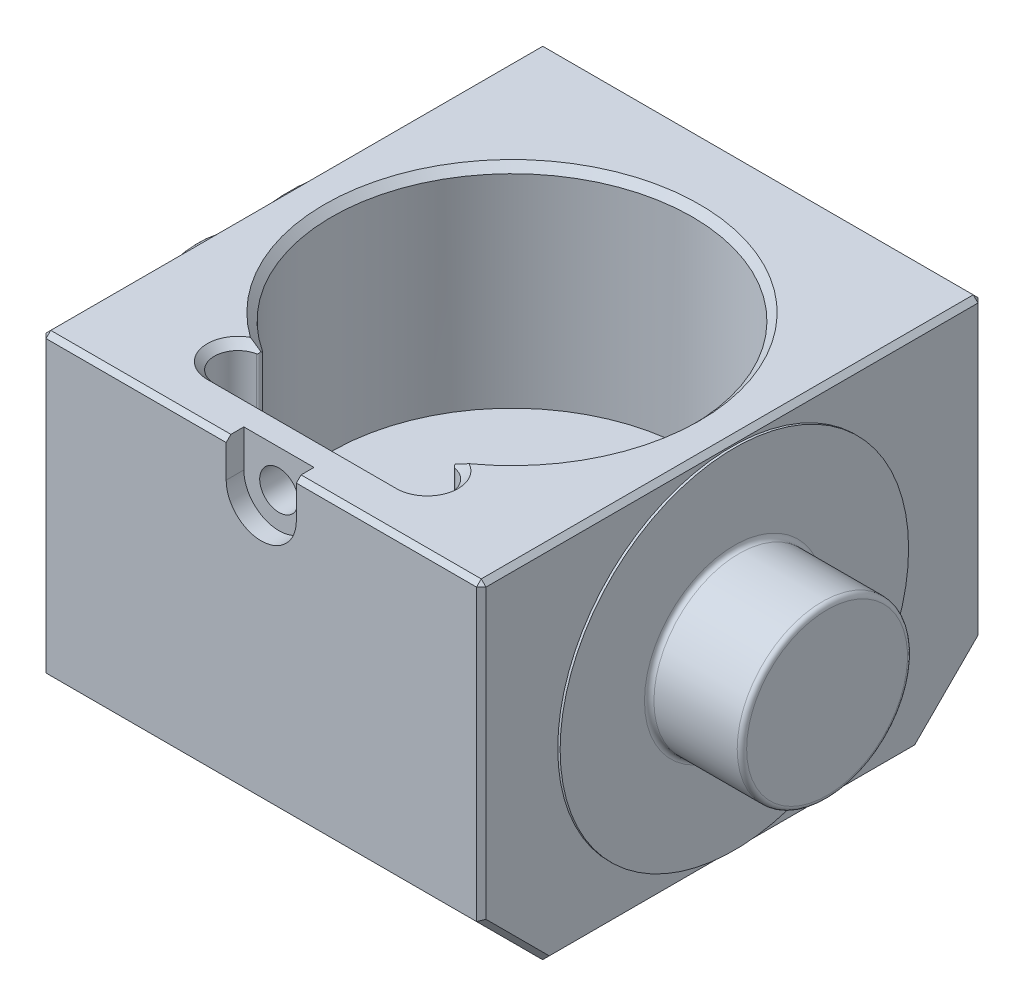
ISO-10303-21;
HEADER;
FILE_DESCRIPTION(('STEP AP214'),'2;1');
FILE_NAME('part.step','',(''),(''),'','','');
FILE_SCHEMA(('AUTOMOTIVE_DESIGN { 1 0 10303 214 1 1 1 1 }'));
ENDSEC;
DATA;
#1=APPLICATION_CONTEXT('core data for automotive mechanical design processes');
#2=APPLICATION_PROTOCOL_DEFINITION('international standard','automotive_design',2000,#1);
#3=PRODUCT_CONTEXT('',#1,'mechanical');
#4=PRODUCT('Part','Part','',(#3));
#5=PRODUCT_RELATED_PRODUCT_CATEGORY('part','',(#4));
#6=PRODUCT_DEFINITION_FORMATION('','',#4);
#7=PRODUCT_DEFINITION_CONTEXT('part definition',#1,'design');
#8=PRODUCT_DEFINITION('design','',#6,#7);
#9=PRODUCT_DEFINITION_SHAPE('','',#8);
#10=(LENGTH_UNIT() NAMED_UNIT(*) SI_UNIT(.MILLI.,.METRE.));
#11=(NAMED_UNIT(*) PLANE_ANGLE_UNIT() SI_UNIT($,.RADIAN.));
#12=(NAMED_UNIT(*) SI_UNIT($,.STERADIAN.) SOLID_ANGLE_UNIT());
#13=UNCERTAINTY_MEASURE_WITH_UNIT(LENGTH_MEASURE(1.E-05),#10,'distance_accuracy_value','');
#14=(GEOMETRIC_REPRESENTATION_CONTEXT(3) GLOBAL_UNCERTAINTY_ASSIGNED_CONTEXT((#13)) GLOBAL_UNIT_ASSIGNED_CONTEXT((#10,
#11,#12)) REPRESENTATION_CONTEXT('',''));
#15=CARTESIAN_POINT('',(0.,0.,0.));
#16=DIRECTION('',(0.,0.,1.));
#17=DIRECTION('',(1.,0.,0.));
#18=AXIS2_PLACEMENT_3D('',#15,#16,#17);
#19=CARTESIAN_POINT('',(23.25,18.55,26.5));
#20=DIRECTION('',(0.,-0.707106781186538,-0.707106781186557));
#21=DIRECTION('',(-1.,0.,0.));
#22=AXIS2_PLACEMENT_3D('',#19,#20,#21);
#23=PLANE('',#22);
#24=DIRECTION('',(0.,-0.707106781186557,0.707106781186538));
#25=VECTOR('',#24,1.);
#26=CARTESIAN_POINT('',(3.7084,18.55,26.5));
#27=LINE('',#26,#25);
#28=CARTESIAN_POINT('',(3.7084,18.55,26.5));
#29=VERTEX_POINT('',#28);
#30=CARTESIAN_POINT('',(3.7084,19.05,26.));
#31=VERTEX_POINT('',#30);
#32=EDGE_CURVE('E12',#29,#31,#27,.F.);
#33=ORIENTED_EDGE('',*,*,#32,.F.);
#34=DIRECTION('',(-1.,0.,0.));
#35=VECTOR('',#34,1.);
#36=CARTESIAN_POINT('',(23.25,18.55,26.5));
#37=LINE('',#36,#35);
#38=CARTESIAN_POINT('',(22.75,18.55,26.5));
#39=VERTEX_POINT('',#38);
#40=EDGE_CURVE('E325',#39,#29,#37,.T.);
#41=ORIENTED_EDGE('',*,*,#40,.F.);
#42=DIRECTION('',(0.,0.707106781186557,-0.707106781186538));
#43=VECTOR('',#42,1.);
#44=CARTESIAN_POINT('',(22.75,18.55,26.5));
#45=LINE('',#44,#43);
#46=CARTESIAN_POINT('',(22.75,19.05,26.));
#47=VERTEX_POINT('',#46);
#48=EDGE_CURVE('E387',#47,#39,#45,.F.);
#49=ORIENTED_EDGE('',*,*,#48,.F.);
#50=DIRECTION('',(1.,0.,0.));
#51=VECTOR('',#50,1.);
#52=CARTESIAN_POINT('',(23.25,19.05,26.));
#53=LINE('',#52,#51);
#54=EDGE_CURVE('E360',#31,#47,#53,.T.);
#55=ORIENTED_EDGE('',*,*,#54,.F.);
#56=EDGE_LOOP('',(#33,#41,#49,#55));
#57=FACE_BOUND('',#56,.T.);
#58=ADVANCED_FACE('F34',(#57),#23,.F.);
#59=CARTESIAN_POINT('',(0.,15.11,-26.501));
#60=DIRECTION('',(0.,0.,1.));
#61=DIRECTION('',(1.,0.,0.));
#62=AXIS2_PLACEMENT_3D('',#59,#60,#61);
#63=CYLINDRICAL_SURFACE('',#62,2.032);
#64=CARTESIAN_POINT('',(0.,15.11,21.45793));
#65=DIRECTION('',(0.,0.,1.));
#66=DIRECTION('',(1.,0.,0.));
#67=AXIS2_PLACEMENT_3D('',#64,#65,#66);
#68=CIRCLE('',#67,2.032);
#69=CARTESIAN_POINT('',(2.032,15.11,21.45793));
#70=VERTEX_POINT('',#69);
#71=EDGE_CURVE('E255',#70,#70,#68,.F.);
#72=CARTESIAN_POINT('',(0.,15.11,24.63293));
#73=DIRECTION('',(0.,0.,1.));
#74=DIRECTION('',(1.,0.,0.));
#75=AXIS2_PLACEMENT_3D('',#72,#73,#74);
#76=CIRCLE('',#75,2.032);
#77=CARTESIAN_POINT('',(2.032,15.11,24.63293));
#78=VERTEX_POINT('',#77);
#79=EDGE_CURVE('E247',#78,#78,#76,.F.);
#80=CARTESIAN_POINT('',(2.032,15.11,21.45793));
#81=CARTESIAN_POINT('',(2.032,15.11,21.4910029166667));
#82=CARTESIAN_POINT('',(2.032,15.11,21.5240758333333));
#83=CARTESIAN_POINT('',(2.032,15.11,21.5902216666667));
#84=CARTESIAN_POINT('',(2.032,15.11,21.6232945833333));
#85=CARTESIAN_POINT('',(2.032,15.11,21.6894404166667));
#86=CARTESIAN_POINT('',(2.032,15.11,21.7225133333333));
#87=CARTESIAN_POINT('',(2.032,15.11,21.7886591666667));
#88=CARTESIAN_POINT('',(2.032,15.11,21.8217320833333));
#89=CARTESIAN_POINT('',(2.032,15.11,21.8878779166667));
#90=CARTESIAN_POINT('',(2.032,15.11,21.9209508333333));
#91=CARTESIAN_POINT('',(2.032,15.11,21.9870966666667));
#92=CARTESIAN_POINT('',(2.032,15.11,22.0201695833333));
#93=CARTESIAN_POINT('',(2.032,15.11,22.0863154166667));
#94=CARTESIAN_POINT('',(2.032,15.11,22.1193883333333));
#95=CARTESIAN_POINT('',(2.032,15.11,22.1855341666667));
#96=CARTESIAN_POINT('',(2.032,15.11,22.2186070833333));
#97=CARTESIAN_POINT('',(2.032,15.11,22.2847529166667));
#98=CARTESIAN_POINT('',(2.032,15.11,22.3178258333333));
#99=CARTESIAN_POINT('',(2.032,15.11,22.3839716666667));
#100=CARTESIAN_POINT('',(2.032,15.11,22.4170445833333));
#101=CARTESIAN_POINT('',(2.032,15.11,22.4831904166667));
#102=CARTESIAN_POINT('',(2.032,15.11,22.5162633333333));
#103=CARTESIAN_POINT('',(2.032,15.11,22.5824091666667));
#104=CARTESIAN_POINT('',(2.032,15.11,22.6154820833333));
#105=CARTESIAN_POINT('',(2.032,15.11,22.6816279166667));
#106=CARTESIAN_POINT('',(2.032,15.11,22.7147008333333));
#107=CARTESIAN_POINT('',(2.032,15.11,22.7808466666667));
#108=CARTESIAN_POINT('',(2.032,15.11,22.8139195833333));
#109=CARTESIAN_POINT('',(2.032,15.11,22.8800654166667));
#110=CARTESIAN_POINT('',(2.032,15.11,22.9131383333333));
#111=CARTESIAN_POINT('',(2.032,15.11,22.9792841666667));
#112=CARTESIAN_POINT('',(2.032,15.11,23.0123570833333));
#113=CARTESIAN_POINT('',(2.032,15.11,23.0785029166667));
#114=CARTESIAN_POINT('',(2.032,15.11,23.1115758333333));
#115=CARTESIAN_POINT('',(2.032,15.11,23.1777216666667));
#116=CARTESIAN_POINT('',(2.032,15.11,23.2107945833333));
#117=CARTESIAN_POINT('',(2.032,15.11,23.2769404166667));
#118=CARTESIAN_POINT('',(2.032,15.11,23.3100133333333));
#119=CARTESIAN_POINT('',(2.032,15.11,23.3761591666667));
#120=CARTESIAN_POINT('',(2.032,15.11,23.4092320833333));
#121=CARTESIAN_POINT('',(2.032,15.11,23.4753779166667));
#122=CARTESIAN_POINT('',(2.032,15.11,23.5084508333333));
#123=CARTESIAN_POINT('',(2.032,15.11,23.5745966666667));
#124=CARTESIAN_POINT('',(2.032,15.11,23.6076695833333));
#125=CARTESIAN_POINT('',(2.032,15.11,23.6738154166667));
#126=CARTESIAN_POINT('',(2.032,15.11,23.7068883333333));
#127=CARTESIAN_POINT('',(2.032,15.11,23.7730341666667));
#128=CARTESIAN_POINT('',(2.032,15.11,23.8061070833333));
#129=CARTESIAN_POINT('',(2.032,15.11,23.8722529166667));
#130=CARTESIAN_POINT('',(2.032,15.11,23.9053258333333));
#131=CARTESIAN_POINT('',(2.032,15.11,23.9714716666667));
#132=CARTESIAN_POINT('',(2.032,15.11,24.0045445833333));
#133=CARTESIAN_POINT('',(2.032,15.11,24.0706904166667));
#134=CARTESIAN_POINT('',(2.032,15.11,24.1037633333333));
#135=CARTESIAN_POINT('',(2.032,15.11,24.1699091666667));
#136=CARTESIAN_POINT('',(2.032,15.11,24.2029820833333));
#137=CARTESIAN_POINT('',(2.032,15.11,24.2691279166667));
#138=CARTESIAN_POINT('',(2.032,15.11,24.3022008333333));
#139=CARTESIAN_POINT('',(2.032,15.11,24.3683466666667));
#140=CARTESIAN_POINT('',(2.032,15.11,24.4014195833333));
#141=CARTESIAN_POINT('',(2.032,15.11,24.4675654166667));
#142=CARTESIAN_POINT('',(2.032,15.11,24.5006383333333));
#143=CARTESIAN_POINT('',(2.032,15.11,24.5667841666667));
#144=CARTESIAN_POINT('',(2.032,15.11,24.5998570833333));
#145=CARTESIAN_POINT('',(2.032,15.11,24.63293));
#146=B_SPLINE_CURVE_WITH_KNOTS('',3,(#80,#81,#82,#83,#84,#85,#86,#87,#88,#89,#90,#91,#92,#93,
#94,#95,#96,#97,#98,#99,#100,#101,#102,#103,#104,#105,#106,#107,#108,#109,#110,#111,#112,#113,
#114,#115,#116,#117,#118,#119,#120,#121,#122,#123,#124,#125,#126,#127,#128,#129,#130,#131,#132,
#133,#134,#135,#136,#137,#138,#139,#140,#141,#142,#143,#144,#145),.UNSPECIFIED.,.F.,.F.,(4,2,2,
2,2,2,2,2,2,2,2,2,2,2,2,2,2,2,2,2,2,2,2,2,2,2,2,2,2,2,2,2,4),(0.,0.0992187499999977,
0.198437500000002,0.29765625,0.396874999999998,0.496093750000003,0.5953125,0.694531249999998,
0.793749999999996,0.892968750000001,0.992187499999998,1.09140625,1.190625,1.28984375,1.3890625,
1.48828125,1.5875,1.68671875,1.7859375,1.88515625,1.984375,2.08359375,2.1828125,2.28203125,
2.38125,2.48046875,2.5796875,2.67890624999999,2.778125,2.87734375,2.97656249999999,3.07578125,
3.175),.UNSPECIFIED.);
#147=EDGE_CURVE('BSEAM568',#70,#78,#146,.T.);
#148=ORIENTED_EDGE('',*,*,#71,.T.);
#149=ORIENTED_EDGE('',*,*,#79,.F.);
#150=ORIENTED_EDGE('',*,*,#147,.T.);
#151=ORIENTED_EDGE('',*,*,#147,.F.);
#152=EDGE_LOOP('',(#148,#150,#149,#151));
#153=FACE_BOUND('',#152,.T.);
#154=ADVANCED_FACE('F568',(#153),#63,.F.);
#155=CARTESIAN_POINT('',(-23.25,0.,0.));
#156=DIRECTION('',(1.,0.,0.));
#157=DIRECTION('',(0.,0.,-1.));
#158=AXIS2_PLACEMENT_3D('',#155,#156,#157);
#159=PLANE('',#158);
#160=DIRECTION('',(0.,0.707106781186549,0.707106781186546));
#161=VECTOR('',#160,1.);
#162=CARTESIAN_POINT('',(-23.25,-11.7114466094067,26.1464466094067));
#163=LINE('',#162,#161);
#164=CARTESIAN_POINT('',(-23.25,-18.55,19.3078932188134));
#165=VERTEX_POINT('',#164);
#166=CARTESIAN_POINT('',(-23.25,-11.8578932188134,26.));
#167=VERTEX_POINT('',#166);
#168=EDGE_CURVE('E353',#165,#167,#163,.T.);
#169=ORIENTED_EDGE('',*,*,#168,.T.);
#170=DIRECTION('',(0.,1.,0.));
#171=VECTOR('',#170,1.);
#172=CARTESIAN_POINT('',(-23.25,0.,26.));
#173=LINE('',#172,#171);
#174=CARTESIAN_POINT('',(-23.25,18.55,26.));
#175=VERTEX_POINT('',#174);
#176=EDGE_CURVE('E355',#167,#175,#173,.T.);
#177=ORIENTED_EDGE('',*,*,#176,.T.);
#178=DIRECTION('',(0.,0.,-1.));
#179=VECTOR('',#178,1.);
#180=CARTESIAN_POINT('',(-23.25,18.55,0.));
#181=LINE('',#180,#179);
#182=CARTESIAN_POINT('',(-23.25,18.55,-26.));
#183=VERTEX_POINT('',#182);
#184=EDGE_CURVE('E345',#175,#183,#181,.T.);
#185=ORIENTED_EDGE('',*,*,#184,.T.);
#186=DIRECTION('',(0.,-1.,0.));
#187=VECTOR('',#186,1.);
#188=CARTESIAN_POINT('',(-23.25,0.,-26.));
#189=LINE('',#188,#187);
#190=CARTESIAN_POINT('',(-23.25,-11.8578932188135,-26.));
#191=VERTEX_POINT('',#190);
#192=EDGE_CURVE('E347',#183,#191,#189,.T.);
#193=ORIENTED_EDGE('',*,*,#192,.T.);
#194=DIRECTION('',(0.,-0.707106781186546,0.707106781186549));
#195=VECTOR('',#194,1.);
#196=CARTESIAN_POINT('',(-23.25,-18.6964466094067,-19.1614466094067));
#197=LINE('',#196,#195);
#198=CARTESIAN_POINT('',(-23.25,-18.55,-19.3078932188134));
#199=VERTEX_POINT('',#198);
#200=EDGE_CURVE('E349',#191,#199,#197,.T.);
#201=ORIENTED_EDGE('',*,*,#200,.T.);
#202=DIRECTION('',(0.,0.,1.));
#203=VECTOR('',#202,1.);
#204=CARTESIAN_POINT('',(-23.25,-18.55,0.));
#205=LINE('',#204,#203);
#206=EDGE_CURVE('E351',#199,#165,#205,.T.);
#207=ORIENTED_EDGE('',*,*,#206,.T.);
#208=EDGE_LOOP('',(#169,#177,#185,#193,#201,#207));
#209=FACE_BOUND('',#208,.T.);
#210=CARTESIAN_POINT('',(-23.25,0.,0.));
#211=DIRECTION('',(1.,0.,0.));
#212=DIRECTION('',(0.,0.,-1.));
#213=AXIS2_PLACEMENT_3D('',#210,#211,#212);
#214=CIRCLE('',#213,18.415);
#215=CARTESIAN_POINT('',(-23.25,0.,-18.415));
#216=VERTEX_POINT('',#215);
#217=EDGE_CURVE('E289',#216,#216,#214,.F.);
#218=ORIENTED_EDGE('',*,*,#217,.F.);
#219=EDGE_LOOP('',(#218));
#220=FACE_BOUND('',#219,.T.);
#221=ADVANCED_FACE('F570',(#209,#220),#159,.F.);
#222=CARTESIAN_POINT('',(23.25,0.,0.));
#223=DIRECTION('',(1.,0.,0.));
#224=DIRECTION('',(0.,0.,-1.));
#225=AXIS2_PLACEMENT_3D('',#222,#223,#224);
#226=PLANE('',#225);
#227=DIRECTION('',(0.,-1.,0.));
#228=VECTOR('',#227,1.);
#229=CARTESIAN_POINT('',(23.25,-12.065,26.));
#230=LINE('',#229,#228);
#231=CARTESIAN_POINT('',(23.25,18.55,26.));
#232=VERTEX_POINT('',#231);
#233=CARTESIAN_POINT('',(23.25,-11.8578932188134,26.));
#234=VERTEX_POINT('',#233);
#235=EDGE_CURVE('E314',#232,#234,#230,.T.);
#236=ORIENTED_EDGE('',*,*,#235,.T.);
#237=DIRECTION('',(0.,-0.707106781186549,-0.707106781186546));
#238=VECTOR('',#237,1.);
#239=CARTESIAN_POINT('',(23.25,-18.9289466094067,18.9289466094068));
#240=LINE('',#239,#238);
#241=CARTESIAN_POINT('',(23.25,-18.55,19.3078932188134));
#242=VERTEX_POINT('',#241);
#243=EDGE_CURVE('E316',#234,#242,#240,.T.);
#244=ORIENTED_EDGE('',*,*,#243,.T.);
#245=DIRECTION('',(0.,0.,-1.));
#246=VECTOR('',#245,1.);
#247=CARTESIAN_POINT('',(23.25,-18.55,-19.515));
#248=LINE('',#247,#246);
#249=CARTESIAN_POINT('',(23.25,-18.55,-19.3078932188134));
#250=VERTEX_POINT('',#249);
#251=EDGE_CURVE('E312',#242,#250,#248,.T.);
#252=ORIENTED_EDGE('',*,*,#251,.T.);
#253=DIRECTION('',(0.,0.707106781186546,-0.707106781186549));
#254=VECTOR('',#253,1.);
#255=CARTESIAN_POINT('',(23.25,-18.9289466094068,-18.9289466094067));
#256=LINE('',#255,#254);
#257=CARTESIAN_POINT('',(23.25,-11.8578932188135,-26.));
#258=VERTEX_POINT('',#257);
#259=EDGE_CURVE('E310',#250,#258,#256,.T.);
#260=ORIENTED_EDGE('',*,*,#259,.T.);
#261=DIRECTION('',(0.,1.,0.));
#262=VECTOR('',#261,1.);
#263=CARTESIAN_POINT('',(23.25,19.05,-26.));
#264=LINE('',#263,#262);
#265=CARTESIAN_POINT('',(23.25,18.55,-26.));
#266=VERTEX_POINT('',#265);
#267=EDGE_CURVE('E308',#258,#266,#264,.T.);
#268=ORIENTED_EDGE('',*,*,#267,.T.);
#269=DIRECTION('',(0.,0.,1.));
#270=VECTOR('',#269,1.);
#271=CARTESIAN_POINT('',(23.25,18.55,26.5));
#272=LINE('',#271,#270);
#273=EDGE_CURVE('E306',#266,#232,#272,.T.);
#274=ORIENTED_EDGE('',*,*,#273,.T.);
#275=EDGE_LOOP('',(#236,#244,#252,#260,#268,#274));
#276=FACE_BOUND('',#275,.T.);
#277=CARTESIAN_POINT('',(23.25,0.,0.));
#278=DIRECTION('',(-1.,0.,0.));
#279=DIRECTION('',(0.,0.,1.));
#280=AXIS2_PLACEMENT_3D('',#277,#278,#279);
#281=CIRCLE('',#280,18.415);
#282=CARTESIAN_POINT('',(23.25,0.,18.415));
#283=VERTEX_POINT('',#282);
#284=EDGE_CURVE('E286',#283,#283,#281,.T.);
#285=ORIENTED_EDGE('',*,*,#284,.T.);
#286=EDGE_LOOP('',(#285));
#287=FACE_BOUND('',#286,.T.);
#288=ADVANCED_FACE('F577',(#276,#287),#226,.T.);
#289=CARTESIAN_POINT('',(23.25,19.05,-26.5));
#290=DIRECTION('',(0.,0.,1.));
#291=DIRECTION('',(0.,-1.,0.));
#292=AXIS2_PLACEMENT_3D('',#289,#290,#291);
#293=PLANE('',#292);
#294=DIRECTION('',(1.,0.,0.));
#295=VECTOR('',#294,1.);
#296=CARTESIAN_POINT('',(23.25,18.55,-26.5));
#297=LINE('',#296,#295);
#298=CARTESIAN_POINT('',(-22.75,18.55,-26.5));
#299=VERTEX_POINT('',#298);
#300=CARTESIAN_POINT('',(22.75,18.55,-26.5));
#301=VERTEX_POINT('',#300);
#302=EDGE_CURVE('E339',#299,#301,#297,.T.);
#303=ORIENTED_EDGE('',*,*,#302,.T.);
#304=DIRECTION('',(0.,-1.,0.));
#305=VECTOR('',#304,1.);
#306=CARTESIAN_POINT('',(22.75,-12.065,-26.5));
#307=LINE('',#306,#305);
#308=CARTESIAN_POINT('',(22.75,-12.065,-26.5));
#309=VERTEX_POINT('',#308);
#310=EDGE_CURVE('E343',#301,#309,#307,.T.);
#311=ORIENTED_EDGE('',*,*,#310,.T.);
#312=DIRECTION('',(-1.,0.,0.));
#313=VECTOR('',#312,1.);
#314=CARTESIAN_POINT('',(23.25,-12.065,-26.5));
#315=LINE('',#314,#313);
#316=CARTESIAN_POINT('',(-22.75,-12.065,-26.5));
#317=VERTEX_POINT('',#316);
#318=EDGE_CURVE('E294',#309,#317,#315,.T.);
#319=ORIENTED_EDGE('',*,*,#318,.T.);
#320=DIRECTION('',(0.,1.,0.));
#321=VECTOR('',#320,1.);
#322=CARTESIAN_POINT('',(-22.75,19.05,-26.5));
#323=LINE('',#322,#321);
#324=EDGE_CURVE('E341',#317,#299,#323,.T.);
#325=ORIENTED_EDGE('',*,*,#324,.T.);
#326=EDGE_LOOP('',(#303,#311,#319,#325));
#327=FACE_BOUND('',#326,.T.);
#328=ADVANCED_FACE('F656',(#327),#293,.F.);
#329=CARTESIAN_POINT('',(23.25,19.05,26.5));
#330=DIRECTION('',(0.,-1.,0.));
#331=DIRECTION('',(0.,0.,-1.));
#332=AXIS2_PLACEMENT_3D('',#329,#330,#331);
#333=PLANE('',#332);
#334=CARTESIAN_POINT('',(10.,19.05,18.95793));
#335=DIRECTION('',(0.,-1.,0.));
#336=DIRECTION('',(0.,0.,-1.));
#337=AXIS2_PLACEMENT_3D('',#334,#335,#336);
#338=CIRCLE('',#337,3.26200000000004);
#339=CARTESIAN_POINT('',(11.5610747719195,19.05,16.0937216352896));
#340=VERTEX_POINT('',#339);
#341=CARTESIAN_POINT('',(10.,19.05,22.21993));
#342=VERTEX_POINT('',#341);
#343=EDGE_CURVE('E434',#340,#342,#338,.T.);
#344=ORIENTED_EDGE('',*,*,#343,.T.);
#345=DIRECTION('',(-1.,0.,0.));
#346=VECTOR('',#345,1.);
#347=CARTESIAN_POINT('',(23.25,19.05,22.21993));
#348=LINE('',#347,#346);
#349=CARTESIAN_POINT('',(-10.,19.05,22.21993));
#350=VERTEX_POINT('',#349);
#351=EDGE_CURVE('E436',#342,#350,#348,.T.);
#352=ORIENTED_EDGE('',*,*,#351,.T.);
#353=CARTESIAN_POINT('',(-10.,19.05,18.95793));
#354=DIRECTION('',(0.,-1.,0.));
#355=DIRECTION('',(0.,0.,-1.));
#356=AXIS2_PLACEMENT_3D('',#353,#354,#355);
#357=CIRCLE('',#356,3.26200000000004);
#358=CARTESIAN_POINT('',(-11.5610747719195,19.05,16.0937216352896));
#359=VERTEX_POINT('',#358);
#360=EDGE_CURVE('E429',#350,#359,#357,.T.);
#361=ORIENTED_EDGE('',*,*,#360,.T.);
#362=CARTESIAN_POINT('',(0.,19.05,0.));
#363=DIRECTION('',(0.,-1.,0.));
#364=DIRECTION('',(0.,0.,-1.));
#365=AXIS2_PLACEMENT_3D('',#362,#363,#364);
#366=CIRCLE('',#365,19.81581);
#367=EDGE_CURVE('E432',#359,#340,#366,.T.);
#368=ORIENTED_EDGE('',*,*,#367,.T.);
#369=EDGE_LOOP('',(#344,#352,#361,#368));
#370=FACE_BOUND('',#369,.T.);
#371=DIRECTION('',(-1.,0.,0.));
#372=VECTOR('',#371,1.);
#373=CARTESIAN_POINT('',(23.25,19.05,24.63293));
#374=LINE('',#373,#372);
#375=CARTESIAN_POINT('',(3.7084,19.05,24.63293));
#376=VERTEX_POINT('',#375);
#377=CARTESIAN_POINT('',(-3.7084,19.05,24.63293));
#378=VERTEX_POINT('',#377);
#379=EDGE_CURVE('E249',#376,#378,#374,.T.);
#380=ORIENTED_EDGE('',*,*,#379,.F.);
#381=DIRECTION('',(0.,0.,1.));
#382=VECTOR('',#381,1.);
#383=CARTESIAN_POINT('',(3.7084,19.05,26.5));
#384=LINE('',#383,#382);
#385=EDGE_CURVE('E252',#376,#31,#384,.T.);
#386=ORIENTED_EDGE('',*,*,#385,.T.);
#387=ORIENTED_EDGE('',*,*,#54,.T.);
#388=DIRECTION('',(0.,0.,-1.));
#389=VECTOR('',#388,1.);
#390=CARTESIAN_POINT('',(22.75,19.05,-26.5));
#391=LINE('',#390,#389);
#392=CARTESIAN_POINT('',(22.75,19.05,-26.));
#393=VERTEX_POINT('',#392);
#394=EDGE_CURVE('E364',#47,#393,#391,.T.);
#395=ORIENTED_EDGE('',*,*,#394,.T.);
#396=DIRECTION('',(-1.,0.,0.));
#397=VECTOR('',#396,1.);
#398=CARTESIAN_POINT('',(23.25,19.05,-26.));
#399=LINE('',#398,#397);
#400=CARTESIAN_POINT('',(-22.75,19.05,-26.));
#401=VERTEX_POINT('',#400);
#402=EDGE_CURVE('E366',#393,#401,#399,.T.);
#403=ORIENTED_EDGE('',*,*,#402,.T.);
#404=DIRECTION('',(0.,0.,1.));
#405=VECTOR('',#404,1.);
#406=CARTESIAN_POINT('',(-22.75,19.05,26.5));
#407=LINE('',#406,#405);
#408=CARTESIAN_POINT('',(-22.75,19.05,26.));
#409=VERTEX_POINT('',#408);
#410=EDGE_CURVE('E358',#401,#409,#407,.T.);
#411=ORIENTED_EDGE('',*,*,#410,.T.);
#412=CARTESIAN_POINT('',(-3.7084,19.05,26.));
#413=VERTEX_POINT('',#412);
#414=EDGE_CURVE('E361',#409,#413,#53,.T.);
#415=ORIENTED_EDGE('',*,*,#414,.T.);
#416=DIRECTION('',(0.,0.,-1.));
#417=VECTOR('',#416,1.);
#418=CARTESIAN_POINT('',(-3.7084,19.05,26.5));
#419=LINE('',#418,#417);
#420=EDGE_CURVE('E49',#413,#378,#419,.T.);
#421=ORIENTED_EDGE('',*,*,#420,.T.);
#422=EDGE_LOOP('',(#380,#386,#387,#395,#403,#411,#415,#421));
#423=FACE_BOUND('',#422,.T.);
#424=ADVANCED_FACE('F664',(#370,#423),#333,.F.);
#425=CARTESIAN_POINT('',(23.25,19.05,26.5));
#426=DIRECTION('',(0.,0.,-1.));
#427=DIRECTION('',(0.,1.,0.));
#428=AXIS2_PLACEMENT_3D('',#425,#426,#427);
#429=PLANE('',#428);
#430=ORIENTED_EDGE('',*,*,#40,.T.);
#431=DIRECTION('',(0.,1.,0.));
#432=VECTOR('',#431,1.);
#433=CARTESIAN_POINT('',(3.7084,22.99,26.5));
#434=LINE('',#433,#432);
#435=CARTESIAN_POINT('',(3.7084,15.11,26.5));
#436=VERTEX_POINT('',#435);
#437=EDGE_CURVE('E236',#436,#29,#434,.T.);
#438=ORIENTED_EDGE('',*,*,#437,.F.);
#439=CARTESIAN_POINT('',(0.,15.11,26.5));
#440=DIRECTION('',(0.,0.,1.));
#441=DIRECTION('',(1.,0.,0.));
#442=AXIS2_PLACEMENT_3D('',#439,#440,#441);
#443=CIRCLE('',#442,3.7084);
#444=CARTESIAN_POINT('',(-3.7084,15.11,26.5));
#445=VERTEX_POINT('',#444);
#446=EDGE_CURVE('E226',#445,#436,#443,.T.);
#447=ORIENTED_EDGE('',*,*,#446,.F.);
#448=DIRECTION('',(0.,-1.,0.));
#449=VECTOR('',#448,1.);
#450=CARTESIAN_POINT('',(-3.7084,22.99,26.5));
#451=LINE('',#450,#449);
#452=CARTESIAN_POINT('',(-3.7084,18.55,26.5));
#453=VERTEX_POINT('',#452);
#454=EDGE_CURVE('E218',#453,#445,#451,.T.);
#455=ORIENTED_EDGE('',*,*,#454,.F.);
#456=CARTESIAN_POINT('',(-22.75,18.55,26.5));
#457=VERTEX_POINT('',#456);
#458=EDGE_CURVE('E324',#453,#457,#37,.T.);
#459=ORIENTED_EDGE('',*,*,#458,.T.);
#460=DIRECTION('',(0.,-1.,0.));
#461=VECTOR('',#460,1.);
#462=CARTESIAN_POINT('',(-22.75,19.05,26.5));
#463=LINE('',#462,#461);
#464=CARTESIAN_POINT('',(-22.75,-12.065,26.5));
#465=VERTEX_POINT('',#464);
#466=EDGE_CURVE('E327',#457,#465,#463,.T.);
#467=ORIENTED_EDGE('',*,*,#466,.T.);
#468=DIRECTION('',(1.,0.,0.));
#469=VECTOR('',#468,1.);
#470=CARTESIAN_POINT('',(23.25,-12.065,26.5));
#471=LINE('',#470,#469);
#472=CARTESIAN_POINT('',(22.75,-12.065,26.5));
#473=VERTEX_POINT('',#472);
#474=EDGE_CURVE('E303',#465,#473,#471,.T.);
#475=ORIENTED_EDGE('',*,*,#474,.T.);
#476=DIRECTION('',(0.,1.,0.));
#477=VECTOR('',#476,1.);
#478=CARTESIAN_POINT('',(22.75,19.05,26.5));
#479=LINE('',#478,#477);
#480=EDGE_CURVE('E329',#473,#39,#479,.T.);
#481=ORIENTED_EDGE('',*,*,#480,.T.);
#482=EDGE_LOOP('',(#430,#438,#447,#455,#459,#467,#475,#481));
#483=FACE_BOUND('',#482,.T.);
#484=ADVANCED_FACE('F239',(#483),#429,.F.);
#485=CARTESIAN_POINT('',(23.25,-19.05,26.5));
#486=DIRECTION('',(0.,1.,0.));
#487=DIRECTION('',(0.,0.,1.));
#488=AXIS2_PLACEMENT_3D('',#485,#486,#487);
#489=PLANE('',#488);
#490=CARTESIAN_POINT('',(0.,-19.05,0.));
#491=DIRECTION('',(0.,1.,0.));
#492=DIRECTION('',(0.,0.,1.));
#493=AXIS2_PLACEMENT_3D('',#490,#491,#492);
#494=CIRCLE('',#493,13.2);
#495=CARTESIAN_POINT('',(0.,-19.05,13.2));
#496=VERTEX_POINT('',#495);
#497=EDGE_CURVE('E532',#496,#496,#494,.T.);
#498=ORIENTED_EDGE('',*,*,#497,.T.);
#499=EDGE_LOOP('',(#498));
#500=FACE_BOUND('',#499,.T.);
#501=DIRECTION('',(1.,0.,0.));
#502=VECTOR('',#501,1.);
#503=CARTESIAN_POINT('',(23.25,-19.05,-19.515));
#504=LINE('',#503,#502);
#505=CARTESIAN_POINT('',(-22.75,-19.05,-19.515));
#506=VERTEX_POINT('',#505);
#507=CARTESIAN_POINT('',(22.75,-19.05,-19.515));
#508=VERTEX_POINT('',#507);
#509=EDGE_CURVE('E300',#506,#508,#504,.T.);
#510=ORIENTED_EDGE('',*,*,#509,.T.);
#511=DIRECTION('',(0.,0.,1.));
#512=VECTOR('',#511,1.);
#513=CARTESIAN_POINT('',(22.75,-19.05,19.515));
#514=LINE('',#513,#512);
#515=CARTESIAN_POINT('',(22.75,-19.05,19.515));
#516=VERTEX_POINT('',#515);
#517=EDGE_CURVE('E333',#508,#516,#514,.T.);
#518=ORIENTED_EDGE('',*,*,#517,.T.);
#519=DIRECTION('',(-1.,0.,0.));
#520=VECTOR('',#519,1.);
#521=CARTESIAN_POINT('',(23.25,-19.05,19.515));
#522=LINE('',#521,#520);
#523=CARTESIAN_POINT('',(-22.75,-19.05,19.515));
#524=VERTEX_POINT('',#523);
#525=EDGE_CURVE('E297',#516,#524,#522,.T.);
#526=ORIENTED_EDGE('',*,*,#525,.T.);
#527=DIRECTION('',(0.,0.,-1.));
#528=VECTOR('',#527,1.);
#529=CARTESIAN_POINT('',(-22.75,-19.05,26.5));
#530=LINE('',#529,#528);
#531=EDGE_CURVE('E331',#524,#506,#530,.T.);
#532=ORIENTED_EDGE('',*,*,#531,.T.);
#533=EDGE_LOOP('',(#510,#518,#526,#532));
#534=FACE_BOUND('',#533,.T.);
#535=ADVANCED_FACE('F653',(#500,#534),#489,.F.);
#536=CARTESIAN_POINT('',(0.,0.,0.));
#537=DIRECTION('',(-1.,0.,0.));
#538=DIRECTION('',(0.,0.,1.));
#539=AXIS2_PLACEMENT_3D('',#536,#537,#538);
#540=CYLINDRICAL_SURFACE('',#539,18.415);
#541=ORIENTED_EDGE('',*,*,#284,.F.);
#542=EDGE_LOOP('',(#541));
#543=FACE_BOUND('',#542,.T.);
#544=CARTESIAN_POINT('',(23.5,0.,0.));
#545=DIRECTION('',(-1.,0.,0.));
#546=DIRECTION('',(0.,0.,1.));
#547=AXIS2_PLACEMENT_3D('',#544,#545,#546);
#548=CIRCLE('',#547,18.415);
#549=CARTESIAN_POINT('',(23.5,0.,18.415));
#550=VERTEX_POINT('',#549);
#551=EDGE_CURVE('E283',#550,#550,#548,.T.);
#552=ORIENTED_EDGE('',*,*,#551,.T.);
#553=EDGE_LOOP('',(#552));
#554=FACE_BOUND('',#553,.T.);
#555=ADVANCED_FACE('F649',(#543,#554),#540,.T.);
#556=CARTESIAN_POINT('',(23.5,18.415,0.));
#557=DIRECTION('',(-1.,0.,0.));
#558=DIRECTION('',(0.,0.,1.));
#559=AXIS2_PLACEMENT_3D('',#556,#557,#558);
#560=PLANE('',#559);
#561=CARTESIAN_POINT('',(23.5,0.,0.));
#562=DIRECTION('',(-1.,0.,0.));
#563=DIRECTION('',(0.,0.,1.));
#564=AXIS2_PLACEMENT_3D('',#561,#562,#563);
#565=CIRCLE('',#564,9.500000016);
#566=CARTESIAN_POINT('',(23.5,0.,9.500000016));
#567=VERTEX_POINT('',#566);
#568=EDGE_CURVE('E550',#567,#567,#565,.T.);
#569=ORIENTED_EDGE('',*,*,#568,.T.);
#570=EDGE_LOOP('',(#569));
#571=FACE_BOUND('',#570,.T.);
#572=ORIENTED_EDGE('',*,*,#551,.F.);
#573=EDGE_LOOP('',(#572));
#574=FACE_BOUND('',#573,.T.);
#575=ADVANCED_FACE('F645',(#571,#574),#560,.F.);
#576=CARTESIAN_POINT('',(0.,0.,0.));
#577=DIRECTION('',(-1.,0.,0.));
#578=DIRECTION('',(0.,0.,1.));
#579=AXIS2_PLACEMENT_3D('',#576,#577,#578);
#580=CYLINDRICAL_SURFACE('',#579,9.);
#581=CARTESIAN_POINT('',(24.000000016,0.,0.));
#582=DIRECTION('',(-1.,0.,0.));
#583=DIRECTION('',(0.,0.,1.));
#584=AXIS2_PLACEMENT_3D('',#581,#582,#583);
#585=CIRCLE('',#584,9.);
#586=CARTESIAN_POINT('',(24.000000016,0.,9.));
#587=VERTEX_POINT('',#586);
#588=EDGE_CURVE('E553',#587,#587,#585,.F.);
#589=ORIENTED_EDGE('',*,*,#588,.T.);
#590=EDGE_LOOP('',(#589));
#591=FACE_BOUND('',#590,.T.);
#592=CARTESIAN_POINT('',(32.799999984,0.,0.));
#593=DIRECTION('',(-1.,0.,0.));
#594=DIRECTION('',(0.,0.,1.));
#595=AXIS2_PLACEMENT_3D('',#592,#593,#594);
#596=CIRCLE('',#595,9.);
#597=CARTESIAN_POINT('',(32.799999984,0.,9.));
#598=VERTEX_POINT('',#597);
#599=EDGE_CURVE('E544',#598,#598,#596,.T.);
#600=ORIENTED_EDGE('',*,*,#599,.T.);
#601=EDGE_LOOP('',(#600));
#602=FACE_BOUND('',#601,.T.);
#603=ADVANCED_FACE('F641',(#591,#602),#580,.T.);
#604=CARTESIAN_POINT('',(33.3,9.,0.));
#605=DIRECTION('',(-1.,0.,0.));
#606=DIRECTION('',(0.,0.,1.));
#607=AXIS2_PLACEMENT_3D('',#604,#605,#606);
#608=PLANE('',#607);
#609=CARTESIAN_POINT('',(33.3,0.,0.));
#610=DIRECTION('',(-1.,0.,0.));
#611=DIRECTION('',(0.,0.,1.));
#612=AXIS2_PLACEMENT_3D('',#609,#610,#611);
#613=CIRCLE('',#612,8.499999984);
#614=CARTESIAN_POINT('',(33.3,0.,8.499999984));
#615=VERTEX_POINT('',#614);
#616=EDGE_CURVE('E547',#615,#615,#613,.F.);
#617=ORIENTED_EDGE('',*,*,#616,.T.);
#618=EDGE_LOOP('',(#617));
#619=FACE_BOUND('',#618,.T.);
#620=ADVANCED_FACE('F637',(#619),#608,.F.);
#621=CARTESIAN_POINT('',(0.,0.,0.));
#622=DIRECTION('',(1.,0.,0.));
#623=DIRECTION('',(0.,0.,1.));
#624=AXIS2_PLACEMENT_3D('',#621,#622,#623);
#625=CYLINDRICAL_SURFACE('',#624,18.415);
#626=ORIENTED_EDGE('',*,*,#217,.T.);
#627=EDGE_LOOP('',(#626));
#628=FACE_BOUND('',#627,.T.);
#629=CARTESIAN_POINT('',(-23.5,0.,0.));
#630=DIRECTION('',(-1.,0.,0.));
#631=DIRECTION('',(0.,0.,1.));
#632=AXIS2_PLACEMENT_3D('',#629,#630,#631);
#633=CIRCLE('',#632,18.415);
#634=CARTESIAN_POINT('',(-23.5,0.,18.415));
#635=VERTEX_POINT('',#634);
#636=EDGE_CURVE('E280',#635,#635,#633,.T.);
#637=ORIENTED_EDGE('',*,*,#636,.F.);
#638=EDGE_LOOP('',(#637));
#639=FACE_BOUND('',#638,.T.);
#640=ADVANCED_FACE('F633',(#628,#639),#625,.T.);
#641=CARTESIAN_POINT('',(-23.5,18.415,0.));
#642=DIRECTION('',(1.,0.,0.));
#643=DIRECTION('',(0.,0.,1.));
#644=AXIS2_PLACEMENT_3D('',#641,#642,#643);
#645=PLANE('',#644);
#646=CARTESIAN_POINT('',(-23.5,0.,0.));
#647=DIRECTION('',(1.,0.,0.));
#648=DIRECTION('',(0.,0.,-1.));
#649=AXIS2_PLACEMENT_3D('',#646,#647,#648);
#650=CIRCLE('',#649,9.500000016);
#651=CARTESIAN_POINT('',(-23.5,0.,-9.500000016));
#652=VERTEX_POINT('',#651);
#653=EDGE_CURVE('E559',#652,#652,#650,.T.);
#654=ORIENTED_EDGE('',*,*,#653,.T.);
#655=EDGE_LOOP('',(#654));
#656=FACE_BOUND('',#655,.T.);
#657=ORIENTED_EDGE('',*,*,#636,.T.);
#658=EDGE_LOOP('',(#657));
#659=FACE_BOUND('',#658,.T.);
#660=ADVANCED_FACE('F629',(#656,#659),#645,.F.);
#661=CARTESIAN_POINT('',(0.,0.,0.));
#662=DIRECTION('',(1.,0.,0.));
#663=DIRECTION('',(0.,0.,1.));
#664=AXIS2_PLACEMENT_3D('',#661,#662,#663);
#665=CYLINDRICAL_SURFACE('',#664,9.);
#666=CARTESIAN_POINT('',(-24.000000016,0.,0.));
#667=DIRECTION('',(1.,0.,0.));
#668=DIRECTION('',(0.,0.,-1.));
#669=AXIS2_PLACEMENT_3D('',#666,#667,#668);
#670=CIRCLE('',#669,9.);
#671=CARTESIAN_POINT('',(-24.000000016,0.,-9.));
#672=VERTEX_POINT('',#671);
#673=EDGE_CURVE('E556',#672,#672,#670,.F.);
#674=ORIENTED_EDGE('',*,*,#673,.T.);
#675=EDGE_LOOP('',(#674));
#676=FACE_BOUND('',#675,.T.);
#677=CARTESIAN_POINT('',(-32.799999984,0.,0.));
#678=DIRECTION('',(1.,0.,0.));
#679=DIRECTION('',(0.,0.,-1.));
#680=AXIS2_PLACEMENT_3D('',#677,#678,#679);
#681=CIRCLE('',#680,9.);
#682=CARTESIAN_POINT('',(-32.799999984,0.,-9.));
#683=VERTEX_POINT('',#682);
#684=EDGE_CURVE('E541',#683,#683,#681,.T.);
#685=ORIENTED_EDGE('',*,*,#684,.T.);
#686=EDGE_LOOP('',(#685));
#687=FACE_BOUND('',#686,.T.);
#688=ADVANCED_FACE('F625',(#676,#687),#665,.T.);
#689=CARTESIAN_POINT('',(-33.3,9.,0.));
#690=DIRECTION('',(1.,0.,0.));
#691=DIRECTION('',(0.,0.,1.));
#692=AXIS2_PLACEMENT_3D('',#689,#690,#691);
#693=PLANE('',#692);
#694=CARTESIAN_POINT('',(-33.3,0.,0.));
#695=DIRECTION('',(1.,0.,0.));
#696=DIRECTION('',(0.,0.,-1.));
#697=AXIS2_PLACEMENT_3D('',#694,#695,#696);
#698=CIRCLE('',#697,8.499999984);
#699=CARTESIAN_POINT('',(-33.3,0.,-8.499999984));
#700=VERTEX_POINT('',#699);
#701=EDGE_CURVE('E538',#700,#700,#698,.F.);
#702=ORIENTED_EDGE('',*,*,#701,.T.);
#703=EDGE_LOOP('',(#702));
#704=FACE_BOUND('',#703,.T.);
#705=ADVANCED_FACE('F621',(#704),#693,.F.);
#706=CARTESIAN_POINT('',(0.,-3.175,0.));
#707=DIRECTION('',(0.,-1.,0.));
#708=DIRECTION('',(0.,0.,-1.));
#709=AXIS2_PLACEMENT_3D('',#706,#707,#708);
#710=PLANE('',#709);
#711=CARTESIAN_POINT('',(0.,-3.175,0.));
#712=DIRECTION('',(0.,-1.,0.));
#713=DIRECTION('',(0.,0.,-1.));
#714=AXIS2_PLACEMENT_3D('',#711,#712,#713);
#715=CIRCLE('',#714,8.83120000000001);
#716=CARTESIAN_POINT('',(0.,-3.175,-8.83120000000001));
#717=VERTEX_POINT('',#716);
#718=EDGE_CURVE('E526',#717,#717,#715,.T.);
#719=ORIENTED_EDGE('',*,*,#718,.T.);
#720=EDGE_LOOP('',(#719));
#721=FACE_BOUND('',#720,.T.);
#722=CARTESIAN_POINT('',(0.,-3.175,0.));
#723=DIRECTION('',(0.,1.,0.));
#724=DIRECTION('',(0.,0.,1.));
#725=AXIS2_PLACEMENT_3D('',#722,#723,#724);
#726=CIRCLE('',#725,19.05381);
#727=CARTESIAN_POINT('',(0.,-3.175,19.05381));
#728=VERTEX_POINT('',#727);
#729=EDGE_CURVE('E277',#728,#728,#726,.T.);
#730=ORIENTED_EDGE('',*,*,#729,.T.);
#731=EDGE_LOOP('',(#730));
#732=FACE_BOUND('',#731,.T.);
#733=ADVANCED_FACE('F617',(#721,#732),#710,.F.);
#734=CARTESIAN_POINT('',(0.,10.1246822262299,0.));
#735=DIRECTION('',(0.,1.,0.));
#736=DIRECTION('',(0.,0.,1.));
#737=AXIS2_PLACEMENT_3D('',#734,#735,#736);
#738=CYLINDRICAL_SURFACE('',#737,19.05381);
#739=CARTESIAN_POINT('',(0.,12.55,0.));
#740=DIRECTION('',(0.,1.,0.));
#741=DIRECTION('',(0.,0.,1.));
#742=AXIS2_PLACEMENT_3D('',#739,#740,#741);
#743=CIRCLE('',#742,19.05381);
#744=CARTESIAN_POINT('',(10.401496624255,12.55,15.9642269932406));
#745=VERTEX_POINT('',#744);
#746=CARTESIAN_POINT('',(-10.401496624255,12.55,15.9642269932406));
#747=VERTEX_POINT('',#746);
#748=EDGE_CURVE('E292',#745,#747,#743,.F.);
#749=ORIENTED_EDGE('',*,*,#748,.F.);
#750=DIRECTION('',(0.,1.,0.));
#751=VECTOR('',#750,1.);
#752=CARTESIAN_POINT('',(10.401496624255,10.1246822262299,15.9642269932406));
#753=LINE('',#752,#751);
#754=CARTESIAN_POINT('',(10.401496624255,18.288,15.9642269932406));
#755=VERTEX_POINT('',#754);
#756=EDGE_CURVE('E778',#745,#755,#753,.T.);
#757=ORIENTED_EDGE('',*,*,#756,.T.);
#758=CARTESIAN_POINT('',(0.,18.288,0.));
#759=DIRECTION('',(0.,-1.,0.));
#760=DIRECTION('',(0.,0.,-1.));
#761=AXIS2_PLACEMENT_3D('',#758,#759,#760);
#762=CIRCLE('',#761,19.05381);
#763=CARTESIAN_POINT('',(-10.401496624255,18.288,15.9642269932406));
#764=VERTEX_POINT('',#763);
#765=EDGE_CURVE('E442',#755,#764,#762,.F.);
#766=ORIENTED_EDGE('',*,*,#765,.T.);
#767=DIRECTION('',(0.,1.,0.));
#768=VECTOR('',#767,1.);
#769=CARTESIAN_POINT('',(-10.401496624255,10.1246822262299,15.9642269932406));
#770=LINE('',#769,#768);
#771=EDGE_CURVE('E447',#764,#747,#770,.F.);
#772=ORIENTED_EDGE('',*,*,#771,.T.);
#773=EDGE_LOOP('',(#749,#757,#766,#772));
#774=FACE_BOUND('',#773,.T.);
#775=ORIENTED_EDGE('',*,*,#729,.F.);
#776=EDGE_LOOP('',(#775));
#777=FACE_BOUND('',#776,.T.);
#778=ADVANCED_FACE('F613',(#774,#777),#738,.F.);
#779=CARTESIAN_POINT('',(0.,-1.92521317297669,0.));
#780=DIRECTION('',(0.,1.,0.));
#781=DIRECTION('',(0.,0.,1.));
#782=AXIS2_PLACEMENT_3D('',#779,#780,#781);
#783=CYLINDRICAL_SURFACE('',#782,8.3312);
#784=CARTESIAN_POINT('',(0.,-3.675,0.));
#785=DIRECTION('',(0.,-1.,0.));
#786=DIRECTION('',(0.,0.,-1.));
#787=AXIS2_PLACEMENT_3D('',#784,#785,#786);
#788=CIRCLE('',#787,8.3312);
#789=CARTESIAN_POINT('',(0.,-3.675,-8.3312));
#790=VERTEX_POINT('',#789);
#791=EDGE_CURVE('E523',#790,#790,#788,.F.);
#792=ORIENTED_EDGE('',*,*,#791,.T.);
#793=EDGE_LOOP('',(#792));
#794=FACE_BOUND('',#793,.T.);
#795=CARTESIAN_POINT('',(0.,-15.375,0.));
#796=DIRECTION('',(0.,1.,0.));
#797=DIRECTION('',(0.,0.,1.));
#798=AXIS2_PLACEMENT_3D('',#795,#796,#797);
#799=CIRCLE('',#798,8.3312);
#800=CARTESIAN_POINT('',(0.,-15.375,8.3312));
#801=VERTEX_POINT('',#800);
#802=EDGE_CURVE('E520',#801,#801,#799,.F.);
#803=ORIENTED_EDGE('',*,*,#802,.T.);
#804=EDGE_LOOP('',(#803));
#805=FACE_BOUND('',#804,.T.);
#806=ADVANCED_FACE('F609',(#794,#805),#783,.F.);
#807=CARTESIAN_POINT('',(-8.3312,-15.875,0.));
#808=DIRECTION('',(0.,1.,0.));
#809=DIRECTION('',(0.,0.,1.));
#810=AXIS2_PLACEMENT_3D('',#807,#808,#809);
#811=PLANE('',#810);
#812=CARTESIAN_POINT('',(0.,-15.875,0.));
#813=DIRECTION('',(0.,1.,0.));
#814=DIRECTION('',(0.,0.,1.));
#815=AXIS2_PLACEMENT_3D('',#812,#813,#814);
#816=CIRCLE('',#815,8.8312);
#817=CARTESIAN_POINT('',(0.,-15.875,8.8312));
#818=VERTEX_POINT('',#817);
#819=EDGE_CURVE('E529',#818,#818,#816,.T.);
#820=ORIENTED_EDGE('',*,*,#819,.T.);
#821=EDGE_LOOP('',(#820));
#822=FACE_BOUND('',#821,.T.);
#823=CARTESIAN_POINT('',(0.,-15.875,0.));
#824=DIRECTION('',(0.,1.,0.));
#825=DIRECTION('',(0.,0.,1.));
#826=AXIS2_PLACEMENT_3D('',#823,#824,#825);
#827=CIRCLE('',#826,12.7);
#828=CARTESIAN_POINT('',(0.,-15.875,12.7));
#829=VERTEX_POINT('',#828);
#830=EDGE_CURVE('E272',#829,#829,#827,.T.);
#831=ORIENTED_EDGE('',*,*,#830,.F.);
#832=EDGE_LOOP('',(#831));
#833=FACE_BOUND('',#832,.T.);
#834=ADVANCED_FACE('F605',(#822,#833),#811,.F.);
#835=CARTESIAN_POINT('',(0.,-1.92521317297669,0.));
#836=DIRECTION('',(0.,1.,0.));
#837=DIRECTION('',(0.,0.,1.));
#838=AXIS2_PLACEMENT_3D('',#835,#836,#837);
#839=CYLINDRICAL_SURFACE('',#838,12.7);
#840=CARTESIAN_POINT('',(0.,-18.55,0.));
#841=DIRECTION('',(0.,1.,0.));
#842=DIRECTION('',(0.,0.,1.));
#843=AXIS2_PLACEMENT_3D('',#840,#841,#842);
#844=CIRCLE('',#843,12.7);
#845=CARTESIAN_POINT('',(0.,-18.55,12.7));
#846=VERTEX_POINT('',#845);
#847=EDGE_CURVE('E535',#846,#846,#844,.F.);
#848=ORIENTED_EDGE('',*,*,#847,.T.);
#849=EDGE_LOOP('',(#848));
#850=FACE_BOUND('',#849,.T.);
#851=ORIENTED_EDGE('',*,*,#830,.T.);
#852=EDGE_LOOP('',(#851));
#853=FACE_BOUND('',#852,.T.);
#854=ADVANCED_FACE('F590',(#850,#853),#839,.F.);
#855=CARTESIAN_POINT('',(-10.,12.55,18.95793));
#856=DIRECTION('',(0.,1.,0.));
#857=DIRECTION('',(0.,0.,1.));
#858=AXIS2_PLACEMENT_3D('',#855,#856,#857);
#859=PLANE('',#858);
#860=ORIENTED_EDGE('',*,*,#748,.T.);
#861=CARTESIAN_POINT('',(-10.5652669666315,12.55,16.2155818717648));
#862=DIRECTION('',(0.,1.,0.));
#863=DIRECTION('',(0.,0.,1.));
#864=AXIS2_PLACEMENT_3D('',#861,#862,#863);
#865=CIRCLE('',#864,0.3);
#866=CARTESIAN_POINT('',(-10.5047026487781,12.55,16.5094048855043));
#867=VERTEX_POINT('',#866);
#868=EDGE_CURVE('E57',#747,#867,#865,.F.);
#869=ORIENTED_EDGE('',*,*,#868,.T.);
#870=CARTESIAN_POINT('',(-10.,12.55,18.95793));
#871=DIRECTION('',(0.,1.,0.));
#872=DIRECTION('',(0.,0.,1.));
#873=AXIS2_PLACEMENT_3D('',#870,#871,#872);
#874=CIRCLE('',#873,2.5);
#875=CARTESIAN_POINT('',(-10.,12.55,21.45793));
#876=VERTEX_POINT('',#875);
#877=EDGE_CURVE('E259',#867,#876,#874,.T.);
#878=ORIENTED_EDGE('',*,*,#877,.T.);
#879=DIRECTION('',(1.,0.,0.));
#880=VECTOR('',#879,1.);
#881=CARTESIAN_POINT('',(-10.,12.55,21.45793));
#882=LINE('',#881,#880);
#883=CARTESIAN_POINT('',(10.,12.55,21.45793));
#884=VERTEX_POINT('',#883);
#885=EDGE_CURVE('E261',#876,#884,#882,.T.);
#886=ORIENTED_EDGE('',*,*,#885,.T.);
#887=CARTESIAN_POINT('',(10.,12.55,18.95793));
#888=DIRECTION('',(0.,1.,0.));
#889=DIRECTION('',(0.,0.,1.));
#890=AXIS2_PLACEMENT_3D('',#887,#888,#889);
#891=CIRCLE('',#890,2.5);
#892=CARTESIAN_POINT('',(10.5047026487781,12.55,16.5094048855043));
#893=VERTEX_POINT('',#892);
#894=EDGE_CURVE('E265',#884,#893,#891,.T.);
#895=ORIENTED_EDGE('',*,*,#894,.T.);
#896=CARTESIAN_POINT('',(10.5652669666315,12.55,16.2155818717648));
#897=DIRECTION('',(0.,1.,0.));
#898=DIRECTION('',(0.,0.,1.));
#899=AXIS2_PLACEMENT_3D('',#896,#897,#898);
#900=CIRCLE('',#899,0.3);
#901=EDGE_CURVE('E515',#893,#745,#900,.F.);
#902=ORIENTED_EDGE('',*,*,#901,.T.);
#903=EDGE_LOOP('',(#860,#869,#878,#886,#895,#902));
#904=FACE_BOUND('',#903,.T.);
#905=ADVANCED_FACE('F586',(#904),#859,.T.);
#906=CARTESIAN_POINT('',(-10.,12.55,18.95793));
#907=DIRECTION('',(0.,1.,0.));
#908=DIRECTION('',(0.,0.,1.));
#909=AXIS2_PLACEMENT_3D('',#906,#907,#908);
#910=CYLINDRICAL_SURFACE('',#909,2.5);
#911=ORIENTED_EDGE('',*,*,#877,.F.);
#912=DIRECTION('',(0.,1.,0.));
#913=VECTOR('',#912,1.);
#914=CARTESIAN_POINT('',(-10.5047026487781,12.55,16.5094048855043));
#915=LINE('',#914,#913);
#916=CARTESIAN_POINT('',(-10.5047026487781,18.288,16.5094048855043));
#917=VERTEX_POINT('',#916);
#918=EDGE_CURVE('E516',#867,#917,#915,.T.);
#919=ORIENTED_EDGE('',*,*,#918,.T.);
#920=CARTESIAN_POINT('',(-10.,18.288,18.95793));
#921=DIRECTION('',(0.,-1.,0.));
#922=DIRECTION('',(0.,0.,-1.));
#923=AXIS2_PLACEMENT_3D('',#920,#921,#922);
#924=CIRCLE('',#923,2.5);
#925=CARTESIAN_POINT('',(-10.,18.288,21.45793));
#926=VERTEX_POINT('',#925);
#927=EDGE_CURVE('E445',#917,#926,#924,.F.);
#928=ORIENTED_EDGE('',*,*,#927,.T.);
#929=DIRECTION('',(0.,1.,0.));
#930=VECTOR('',#929,1.);
#931=CARTESIAN_POINT('',(-10.,12.55,21.45793));
#932=LINE('',#931,#930);
#933=EDGE_CURVE('E268',#876,#926,#932,.T.);
#934=ORIENTED_EDGE('',*,*,#933,.F.);
#935=EDGE_LOOP('',(#911,#919,#928,#934));
#936=FACE_BOUND('',#935,.T.);
#937=ADVANCED_FACE('F589',(#936),#910,.F.);
#938=CARTESIAN_POINT('',(10.,12.55,18.95793));
#939=DIRECTION('',(0.,1.,0.));
#940=DIRECTION('',(0.,0.,1.));
#941=AXIS2_PLACEMENT_3D('',#938,#939,#940);
#942=CYLINDRICAL_SURFACE('',#941,2.5);
#943=CARTESIAN_POINT('',(10.,18.288,18.95793));
#944=DIRECTION('',(0.,-1.,0.));
#945=DIRECTION('',(0.,0.,-1.));
#946=AXIS2_PLACEMENT_3D('',#943,#944,#945);
#947=CIRCLE('',#946,2.5);
#948=CARTESIAN_POINT('',(10.,18.288,21.45793));
#949=VERTEX_POINT('',#948);
#950=CARTESIAN_POINT('',(10.5047026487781,18.288,16.5094048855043));
#951=VERTEX_POINT('',#950);
#952=EDGE_CURVE('E439',#949,#951,#947,.F.);
#953=ORIENTED_EDGE('',*,*,#952,.T.);
#954=DIRECTION('',(0.,1.,0.));
#955=VECTOR('',#954,1.);
#956=CARTESIAN_POINT('',(10.5047026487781,12.55,16.5094048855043));
#957=LINE('',#956,#955);
#958=EDGE_CURVE('E483',#951,#893,#957,.F.);
#959=ORIENTED_EDGE('',*,*,#958,.T.);
#960=ORIENTED_EDGE('',*,*,#894,.F.);
#961=DIRECTION('',(0.,1.,0.));
#962=VECTOR('',#961,1.);
#963=CARTESIAN_POINT('',(10.,12.55,21.45793));
#964=LINE('',#963,#962);
#965=EDGE_CURVE('E269',#884,#949,#964,.T.);
#966=ORIENTED_EDGE('',*,*,#965,.T.);
#967=EDGE_LOOP('',(#953,#959,#960,#966));
#968=FACE_BOUND('',#967,.T.);
#969=ADVANCED_FACE('F591',(#968),#942,.F.);
#970=CARTESIAN_POINT('',(-10.,12.55,21.45793));
#971=DIRECTION('',(0.,0.,1.));
#972=DIRECTION('',(1.,0.,0.));
#973=AXIS2_PLACEMENT_3D('',#970,#971,#972);
#974=PLANE('',#973);
#975=ORIENTED_EDGE('',*,*,#71,.F.);
#976=EDGE_LOOP('',(#975));
#977=FACE_BOUND('',#976,.T.);
#978=ORIENTED_EDGE('',*,*,#933,.T.);
#979=DIRECTION('',(1.,0.,0.));
#980=VECTOR('',#979,1.);
#981=CARTESIAN_POINT('',(-10.,18.288,21.45793));
#982=LINE('',#981,#980);
#983=EDGE_CURVE('E369',#926,#949,#982,.T.);
#984=ORIENTED_EDGE('',*,*,#983,.T.);
#985=ORIENTED_EDGE('',*,*,#965,.F.);
#986=ORIENTED_EDGE('',*,*,#885,.F.);
#987=EDGE_LOOP('',(#978,#984,#985,#986));
#988=FACE_BOUND('',#987,.T.);
#989=ADVANCED_FACE('F594',(#977,#988),#974,.F.);
#990=CARTESIAN_POINT('',(23.25,-12.065,-26.5));
#991=DIRECTION('',(0.,0.707106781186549,0.707106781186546));
#992=DIRECTION('',(-1.,0.,0.));
#993=AXIS2_PLACEMENT_3D('',#990,#991,#992);
#994=PLANE('',#993);
#995=ORIENTED_EDGE('',*,*,#318,.F.);
#996=DIRECTION('',(0.,0.707106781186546,-0.707106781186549));
#997=VECTOR('',#996,1.);
#998=CARTESIAN_POINT('',(22.75,-12.065,-26.5));
#999=LINE('',#998,#997);
#1000=EDGE_CURVE('E337',#309,#508,#999,.F.);
#1001=ORIENTED_EDGE('',*,*,#1000,.T.);
#1002=ORIENTED_EDGE('',*,*,#509,.F.);
#1003=DIRECTION('',(0.,-0.707106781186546,0.707106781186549));
#1004=VECTOR('',#1003,1.);
#1005=CARTESIAN_POINT('',(-22.75,-12.065,-26.5));
#1006=LINE('',#1005,#1004);
#1007=EDGE_CURVE('E335',#506,#317,#1006,.F.);
#1008=ORIENTED_EDGE('',*,*,#1007,.T.);
#1009=EDGE_LOOP('',(#995,#1001,#1002,#1008));
#1010=FACE_BOUND('',#1009,.T.);
#1011=ADVANCED_FACE('F598',(#1010),#994,.F.);
#1012=CARTESIAN_POINT('',(23.25,-19.05,19.515));
#1013=DIRECTION('',(0.,0.707106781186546,-0.707106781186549));
#1014=DIRECTION('',(-1.,0.,0.));
#1015=AXIS2_PLACEMENT_3D('',#1012,#1013,#1014);
#1016=PLANE('',#1015);
#1017=ORIENTED_EDGE('',*,*,#525,.F.);
#1018=DIRECTION('',(0.,-0.707106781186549,-0.707106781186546));
#1019=VECTOR('',#1018,1.);
#1020=CARTESIAN_POINT('',(22.75,-19.05,19.515));
#1021=LINE('',#1020,#1019);
#1022=EDGE_CURVE('E321',#516,#473,#1021,.F.);
#1023=ORIENTED_EDGE('',*,*,#1022,.T.);
#1024=ORIENTED_EDGE('',*,*,#474,.F.);
#1025=DIRECTION('',(0.,0.707106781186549,0.707106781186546));
#1026=VECTOR('',#1025,1.);
#1027=CARTESIAN_POINT('',(-22.75,-19.05,19.515));
#1028=LINE('',#1027,#1026);
#1029=EDGE_CURVE('E319',#465,#524,#1028,.F.);
#1030=ORIENTED_EDGE('',*,*,#1029,.T.);
#1031=EDGE_LOOP('',(#1017,#1023,#1024,#1030));
#1032=FACE_BOUND('',#1031,.T.);
#1033=ADVANCED_FACE('F673',(#1032),#1016,.F.);
#1034=CARTESIAN_POINT('',(-23.25,-18.9289466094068,-18.9289466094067));
#1035=DIRECTION('',(0.707106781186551,0.499999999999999,0.499999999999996));
#1036=DIRECTION('',(0.,-0.707106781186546,0.707106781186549));
#1037=AXIS2_PLACEMENT_3D('',#1034,#1035,#1036);
#1038=PLANE('',#1037);
#1039=DIRECTION('',(-0.678598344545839,0.281084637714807,0.67859834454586));
#1040=VECTOR('',#1039,1.);
#1041=CARTESIAN_POINT('',(-28.6849861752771,-9.60664823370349,-20.5650138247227));
#1042=LINE('',#1041,#1040);
#1043=EDGE_CURVE('E422',#317,#191,#1042,.T.);
#1044=ORIENTED_EDGE('',*,*,#1043,.F.);
#1045=ORIENTED_EDGE('',*,*,#1007,.F.);
#1046=DIRECTION('',(-0.67859834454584,0.678598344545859,0.281084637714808));
#1047=VECTOR('',#1046,1.);
#1048=CARTESIAN_POINT('',(-23.1477783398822,-18.6522216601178,-19.3502348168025));
#1049=LINE('',#1048,#1047);
#1050=EDGE_CURVE('E262',#199,#506,#1049,.F.);
#1051=ORIENTED_EDGE('',*,*,#1050,.F.);
#1052=ORIENTED_EDGE('',*,*,#200,.F.);
#1053=EDGE_LOOP('',(#1044,#1045,#1051,#1052));
#1054=FACE_BOUND('',#1053,.T.);
#1055=ADVANCED_FACE('F677',(#1054),#1038,.F.);
#1056=CARTESIAN_POINT('',(-22.75,-19.05,26.5));
#1057=DIRECTION('',(0.707106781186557,0.707106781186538,0.));
#1058=DIRECTION('',(0.,0.,-1.));
#1059=AXIS2_PLACEMENT_3D('',#1056,#1057,#1058);
#1060=PLANE('',#1059);
#1061=ORIENTED_EDGE('',*,*,#1050,.T.);
#1062=ORIENTED_EDGE('',*,*,#531,.F.);
#1063=DIRECTION('',(-0.678598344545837,0.678598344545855,-0.281084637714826));
#1064=VECTOR('',#1063,1.);
#1065=CARTESIAN_POINT('',(-21.4176561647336,-20.3823438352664,20.0668748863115));
#1066=LINE('',#1065,#1064);
#1067=EDGE_CURVE('E419',#165,#524,#1066,.F.);
#1068=ORIENTED_EDGE('',*,*,#1067,.F.);
#1069=ORIENTED_EDGE('',*,*,#206,.F.);
#1070=EDGE_LOOP('',(#1061,#1062,#1068,#1069));
#1071=FACE_BOUND('',#1070,.T.);
#1072=ADVANCED_FACE('F740',(#1071),#1060,.F.);
#1073=CARTESIAN_POINT('',(-22.75,19.05,-26.5));
#1074=DIRECTION('',(0.707106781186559,0.,0.707106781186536));
#1075=DIRECTION('',(0.,1.,0.));
#1076=AXIS2_PLACEMENT_3D('',#1073,#1074,#1075);
#1077=PLANE('',#1076);
#1078=ORIENTED_EDGE('',*,*,#1043,.T.);
#1079=ORIENTED_EDGE('',*,*,#192,.F.);
#1080=DIRECTION('',(0.707106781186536,0.,-0.707106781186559));
#1081=VECTOR('',#1080,1.);
#1082=CARTESIAN_POINT('',(-22.75,18.55,-26.5));
#1083=LINE('',#1082,#1081);
#1084=EDGE_CURVE('E416',#299,#183,#1083,.F.);
#1085=ORIENTED_EDGE('',*,*,#1084,.F.);
#1086=ORIENTED_EDGE('',*,*,#324,.F.);
#1087=EDGE_LOOP('',(#1078,#1079,#1085,#1086));
#1088=FACE_BOUND('',#1087,.T.);
#1089=ADVANCED_FACE('F736',(#1088),#1077,.F.);
#1090=CARTESIAN_POINT('',(-23.25,-18.9289466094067,18.9289466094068));
#1091=DIRECTION('',(0.707106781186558,0.499999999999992,-0.499999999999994));
#1092=DIRECTION('',(0.,0.707106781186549,0.707106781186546));
#1093=AXIS2_PLACEMENT_3D('',#1090,#1091,#1092);
#1094=PLANE('',#1093);
#1095=ORIENTED_EDGE('',*,*,#1067,.T.);
#1096=ORIENTED_EDGE('',*,*,#1029,.F.);
#1097=DIRECTION('',(-0.678598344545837,0.281084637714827,-0.678598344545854));
#1098=VECTOR('',#1097,1.);
#1099=CARTESIAN_POINT('',(-25.1574318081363,-11.0678090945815,24.0925681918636));
#1100=LINE('',#1099,#1098);
#1101=EDGE_CURVE('E413',#167,#465,#1100,.F.);
#1102=ORIENTED_EDGE('',*,*,#1101,.F.);
#1103=ORIENTED_EDGE('',*,*,#168,.F.);
#1104=EDGE_LOOP('',(#1095,#1096,#1102,#1103));
#1105=FACE_BOUND('',#1104,.T.);
#1106=ADVANCED_FACE('F732',(#1105),#1094,.F.);
#1107=CARTESIAN_POINT('',(-22.75,18.55,-26.5));
#1108=DIRECTION('',(-0.577350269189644,0.577350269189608,-0.577350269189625));
#1109=DIRECTION('',(-0.707106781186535,0.,0.70710678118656));
#1110=AXIS2_PLACEMENT_3D('',#1107,#1108,#1109);
#1111=PLANE('',#1110);
#1112=DIRECTION('',(0.,0.707106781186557,0.707106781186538));
#1113=VECTOR('',#1112,1.);
#1114=CARTESIAN_POINT('',(-22.75,18.55,-26.5));
#1115=LINE('',#1114,#1113);
#1116=EDGE_CURVE('E407',#299,#401,#1115,.T.);
#1117=ORIENTED_EDGE('',*,*,#1116,.F.);
#1118=ORIENTED_EDGE('',*,*,#1084,.T.);
#1119=DIRECTION('',(-0.707106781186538,-0.707106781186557,0.));
#1120=VECTOR('',#1119,1.);
#1121=CARTESIAN_POINT('',(-23.,18.8,-26.));
#1122=LINE('',#1121,#1120);
#1123=EDGE_CURVE('E410',#401,#183,#1122,.T.);
#1124=ORIENTED_EDGE('',*,*,#1123,.F.);
#1125=EDGE_LOOP('',(#1117,#1118,#1124));
#1126=FACE_BOUND('',#1125,.T.);
#1127=ADVANCED_FACE('F728',(#1126),#1111,.T.);
#1128=CARTESIAN_POINT('',(-22.75,19.05,26.5));
#1129=DIRECTION('',(0.707106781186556,0.,-0.707106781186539));
#1130=DIRECTION('',(0.,-1.,0.));
#1131=AXIS2_PLACEMENT_3D('',#1128,#1129,#1130);
#1132=PLANE('',#1131);
#1133=ORIENTED_EDGE('',*,*,#1101,.T.);
#1134=ORIENTED_EDGE('',*,*,#466,.F.);
#1135=DIRECTION('',(-0.707106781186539,0.,-0.707106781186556));
#1136=VECTOR('',#1135,1.);
#1137=CARTESIAN_POINT('',(-23.25,18.55,26.));
#1138=LINE('',#1137,#1136);
#1139=EDGE_CURVE('E404',#175,#457,#1138,.F.);
#1140=ORIENTED_EDGE('',*,*,#1139,.F.);
#1141=ORIENTED_EDGE('',*,*,#176,.F.);
#1142=EDGE_LOOP('',(#1133,#1134,#1140,#1141));
#1143=FACE_BOUND('',#1142,.T.);
#1144=ADVANCED_FACE('F724',(#1143),#1132,.F.);
#1145=CARTESIAN_POINT('',(-22.75,19.05,26.5));
#1146=DIRECTION('',(0.707106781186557,-0.707106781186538,0.));
#1147=DIRECTION('',(0.,0.,1.));
#1148=AXIS2_PLACEMENT_3D('',#1145,#1146,#1147);
#1149=PLANE('',#1148);
#1150=ORIENTED_EDGE('',*,*,#1123,.T.);
#1151=ORIENTED_EDGE('',*,*,#184,.F.);
#1152=DIRECTION('',(0.707106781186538,0.707106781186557,0.));
#1153=VECTOR('',#1152,1.);
#1154=CARTESIAN_POINT('',(-23.25,18.55,26.));
#1155=LINE('',#1154,#1153);
#1156=EDGE_CURVE('E402',#409,#175,#1155,.F.);
#1157=ORIENTED_EDGE('',*,*,#1156,.F.);
#1158=ORIENTED_EDGE('',*,*,#410,.F.);
#1159=EDGE_LOOP('',(#1150,#1151,#1157,#1158));
#1160=FACE_BOUND('',#1159,.T.);
#1161=ADVANCED_FACE('F720',(#1160),#1149,.F.);
#1162=CARTESIAN_POINT('',(23.25,19.05,-26.));
#1163=DIRECTION('',(0.,-0.707106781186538,0.707106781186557));
#1164=DIRECTION('',(-1.,0.,0.));
#1165=AXIS2_PLACEMENT_3D('',#1162,#1163,#1164);
#1166=PLANE('',#1165);
#1167=ORIENTED_EDGE('',*,*,#1116,.T.);
#1168=ORIENTED_EDGE('',*,*,#402,.F.);
#1169=DIRECTION('',(0.,-0.707106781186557,-0.707106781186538));
#1170=VECTOR('',#1169,1.);
#1171=CARTESIAN_POINT('',(22.75,18.8,-26.25));
#1172=LINE('',#1171,#1170);
#1173=EDGE_CURVE('E399',#301,#393,#1172,.F.);
#1174=ORIENTED_EDGE('',*,*,#1173,.F.);
#1175=ORIENTED_EDGE('',*,*,#302,.F.);
#1176=EDGE_LOOP('',(#1167,#1168,#1174,#1175));
#1177=FACE_BOUND('',#1176,.T.);
#1178=ADVANCED_FACE('F716',(#1177),#1166,.F.);
#1179=CARTESIAN_POINT('',(-23.25,18.55,26.));
#1180=DIRECTION('',(-0.577350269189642,0.57735026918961,0.577350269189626));
#1181=DIRECTION('',(0.707106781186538,0.,0.707106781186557));
#1182=AXIS2_PLACEMENT_3D('',#1179,#1180,#1181);
#1183=PLANE('',#1182);
#1184=ORIENTED_EDGE('',*,*,#1156,.T.);
#1185=ORIENTED_EDGE('',*,*,#1139,.T.);
#1186=DIRECTION('',(0.,-0.707106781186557,0.707106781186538));
#1187=VECTOR('',#1186,1.);
#1188=CARTESIAN_POINT('',(-22.75,18.8,26.25));
#1189=LINE('',#1188,#1187);
#1190=EDGE_CURVE('E396',#409,#457,#1189,.T.);
#1191=ORIENTED_EDGE('',*,*,#1190,.F.);
#1192=EDGE_LOOP('',(#1184,#1185,#1191));
#1193=FACE_BOUND('',#1192,.T.);
#1194=ADVANCED_FACE('F712',(#1193),#1183,.T.);
#1195=CARTESIAN_POINT('',(23.25,18.55,-26.));
#1196=DIRECTION('',(0.577350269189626,0.57735026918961,-0.577350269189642));
#1197=DIRECTION('',(-0.707106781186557,0.,-0.707106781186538));
#1198=AXIS2_PLACEMENT_3D('',#1195,#1196,#1197);
#1199=PLANE('',#1198);
#1200=DIRECTION('',(-0.707106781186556,0.,-0.707106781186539));
#1201=VECTOR('',#1200,1.);
#1202=CARTESIAN_POINT('',(23.25,18.55,-26.));
#1203=LINE('',#1202,#1201);
#1204=EDGE_CURVE('E390',#301,#266,#1203,.F.);
#1205=ORIENTED_EDGE('',*,*,#1204,.F.);
#1206=ORIENTED_EDGE('',*,*,#1173,.T.);
#1207=DIRECTION('',(0.707106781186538,-0.707106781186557,0.));
#1208=VECTOR('',#1207,1.);
#1209=CARTESIAN_POINT('',(23.25,18.55,-26.));
#1210=LINE('',#1209,#1208);
#1211=EDGE_CURVE('E393',#266,#393,#1210,.F.);
#1212=ORIENTED_EDGE('',*,*,#1211,.F.);
#1213=EDGE_LOOP('',(#1205,#1206,#1212));
#1214=FACE_BOUND('',#1213,.T.);
#1215=ADVANCED_FACE('F708',(#1214),#1199,.T.);
#1216=DIRECTION('',(0.,0.707106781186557,-0.707106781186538));
#1217=VECTOR('',#1216,1.);
#1218=CARTESIAN_POINT('',(-3.7084,18.55,26.5));
#1219=LINE('',#1218,#1217);
#1220=EDGE_CURVE('E42',#413,#453,#1219,.F.);
#1221=ORIENTED_EDGE('',*,*,#1220,.F.);
#1222=ORIENTED_EDGE('',*,*,#414,.F.);
#1223=ORIENTED_EDGE('',*,*,#1190,.T.);
#1224=ORIENTED_EDGE('',*,*,#458,.F.);
#1225=EDGE_LOOP('',(#1221,#1222,#1223,#1224));
#1226=FACE_BOUND('',#1225,.T.);
#1227=ADVANCED_FACE('F582',(#1226),#23,.F.);
#1228=CARTESIAN_POINT('',(23.25,18.55,0.));
#1229=DIRECTION('',(0.707106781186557,0.707106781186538,0.));
#1230=DIRECTION('',(0.,0.,-1.));
#1231=AXIS2_PLACEMENT_3D('',#1228,#1229,#1230);
#1232=PLANE('',#1231);
#1233=ORIENTED_EDGE('',*,*,#1211,.T.);
#1234=ORIENTED_EDGE('',*,*,#394,.F.);
#1235=DIRECTION('',(-0.707106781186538,0.707106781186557,0.));
#1236=VECTOR('',#1235,1.);
#1237=CARTESIAN_POINT('',(23.,18.8,26.));
#1238=LINE('',#1237,#1236);
#1239=EDGE_CURVE('E384',#232,#47,#1238,.T.);
#1240=ORIENTED_EDGE('',*,*,#1239,.F.);
#1241=ORIENTED_EDGE('',*,*,#273,.F.);
#1242=EDGE_LOOP('',(#1233,#1234,#1240,#1241));
#1243=FACE_BOUND('',#1242,.T.);
#1244=ADVANCED_FACE('F702',(#1243),#1232,.T.);
#1245=CARTESIAN_POINT('',(23.25,0.,-26.));
#1246=DIRECTION('',(0.707106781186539,0.,-0.707106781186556));
#1247=DIRECTION('',(0.,-1.,0.));
#1248=AXIS2_PLACEMENT_3D('',#1245,#1246,#1247);
#1249=PLANE('',#1248);
#1250=ORIENTED_EDGE('',*,*,#1204,.T.);
#1251=ORIENTED_EDGE('',*,*,#267,.F.);
#1252=DIRECTION('',(-0.678598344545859,-0.281084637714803,-0.678598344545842));
#1253=VECTOR('',#1252,1.);
#1254=CARTESIAN_POINT('',(25.5118168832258,-10.921017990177,-23.7381831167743));
#1255=LINE('',#1254,#1253);
#1256=EDGE_CURVE('E381',#309,#258,#1255,.F.);
#1257=ORIENTED_EDGE('',*,*,#1256,.F.);
#1258=ORIENTED_EDGE('',*,*,#310,.F.);
#1259=EDGE_LOOP('',(#1250,#1251,#1257,#1258));
#1260=FACE_BOUND('',#1259,.T.);
#1261=ADVANCED_FACE('F698',(#1260),#1249,.T.);
#1262=CARTESIAN_POINT('',(22.75,18.55,26.5));
#1263=DIRECTION('',(0.577350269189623,0.577350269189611,0.577350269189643));
#1264=DIRECTION('',(0.70710678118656,0.,-0.707106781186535));
#1265=AXIS2_PLACEMENT_3D('',#1262,#1263,#1264);
#1266=PLANE('',#1265);
#1267=ORIENTED_EDGE('',*,*,#1239,.T.);
#1268=ORIENTED_EDGE('',*,*,#48,.T.);
#1269=DIRECTION('',(0.707106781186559,0.,-0.707106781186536));
#1270=VECTOR('',#1269,1.);
#1271=CARTESIAN_POINT('',(22.75,18.55,26.5));
#1272=LINE('',#1271,#1270);
#1273=EDGE_CURVE('E378',#232,#39,#1272,.F.);
#1274=ORIENTED_EDGE('',*,*,#1273,.F.);
#1275=EDGE_LOOP('',(#1267,#1268,#1274));
#1276=FACE_BOUND('',#1275,.T.);
#1277=ADVANCED_FACE('F694',(#1276),#1266,.T.);
#1278=CARTESIAN_POINT('',(23.25,-18.9289466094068,-18.9289466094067));
#1279=DIRECTION('',(0.707106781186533,-0.500000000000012,-0.500000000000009));
#1280=DIRECTION('',(0.,-0.707106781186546,0.707106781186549));
#1281=AXIS2_PLACEMENT_3D('',#1278,#1279,#1280);
#1282=PLANE('',#1281);
#1283=ORIENTED_EDGE('',*,*,#1256,.T.);
#1284=ORIENTED_EDGE('',*,*,#259,.F.);
#1285=DIRECTION('',(-0.67859834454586,-0.678598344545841,-0.281084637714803));
#1286=VECTOR('',#1285,1.);
#1287=CARTESIAN_POINT('',(23.1477783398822,-18.6522216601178,-19.3502348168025));
#1288=LINE('',#1287,#1286);
#1289=EDGE_CURVE('E375',#508,#250,#1288,.F.);
#1290=ORIENTED_EDGE('',*,*,#1289,.F.);
#1291=ORIENTED_EDGE('',*,*,#1000,.F.);
#1292=EDGE_LOOP('',(#1283,#1284,#1290,#1291));
#1293=FACE_BOUND('',#1292,.T.);
#1294=ADVANCED_FACE('F690',(#1293),#1282,.T.);
#1295=CARTESIAN_POINT('',(23.25,0.,26.));
#1296=DIRECTION('',(0.707106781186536,0.,0.707106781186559));
#1297=DIRECTION('',(0.,1.,0.));
#1298=AXIS2_PLACEMENT_3D('',#1295,#1296,#1297);
#1299=PLANE('',#1298);
#1300=ORIENTED_EDGE('',*,*,#1273,.T.);
#1301=ORIENTED_EDGE('',*,*,#480,.F.);
#1302=DIRECTION('',(0.678598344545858,0.281084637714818,-0.678598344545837));
#1303=VECTOR('',#1302,1.);
#1304=CARTESIAN_POINT('',(25.5118168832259,-10.9210179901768,23.7381831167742));
#1305=LINE('',#1304,#1303);
#1306=EDGE_CURVE('E372',#234,#473,#1305,.F.);
#1307=ORIENTED_EDGE('',*,*,#1306,.F.);
#1308=ORIENTED_EDGE('',*,*,#235,.F.);
#1309=EDGE_LOOP('',(#1300,#1301,#1307,#1308));
#1310=FACE_BOUND('',#1309,.T.);
#1311=ADVANCED_FACE('F686',(#1310),#1299,.T.);
#1312=CARTESIAN_POINT('',(23.25,-18.55,0.));
#1313=DIRECTION('',(0.707106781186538,-0.707106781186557,0.));
#1314=DIRECTION('',(0.,0.,1.));
#1315=AXIS2_PLACEMENT_3D('',#1312,#1313,#1314);
#1316=PLANE('',#1315);
#1317=ORIENTED_EDGE('',*,*,#1289,.T.);
#1318=ORIENTED_EDGE('',*,*,#251,.F.);
#1319=DIRECTION('',(-0.678598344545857,-0.678598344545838,0.281084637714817));
#1320=VECTOR('',#1319,1.);
#1321=CARTESIAN_POINT('',(26.9328564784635,-14.8671435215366,17.7824041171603));
#1322=LINE('',#1321,#1320);
#1323=EDGE_CURVE('E370',#516,#242,#1322,.F.);
#1324=ORIENTED_EDGE('',*,*,#1323,.F.);
#1325=ORIENTED_EDGE('',*,*,#517,.F.);
#1326=EDGE_LOOP('',(#1317,#1318,#1324,#1325));
#1327=FACE_BOUND('',#1326,.T.);
#1328=ADVANCED_FACE('F682',(#1327),#1316,.T.);
#1329=CARTESIAN_POINT('',(23.25,-18.9289466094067,18.9289466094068));
#1330=DIRECTION('',(0.707106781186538,-0.500000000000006,0.500000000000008));
#1331=DIRECTION('',(0.,0.707106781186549,0.707106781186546));
#1332=AXIS2_PLACEMENT_3D('',#1329,#1330,#1331);
#1333=PLANE('',#1332);
#1334=ORIENTED_EDGE('',*,*,#1306,.T.);
#1335=ORIENTED_EDGE('',*,*,#1022,.F.);
#1336=ORIENTED_EDGE('',*,*,#1323,.T.);
#1337=ORIENTED_EDGE('',*,*,#243,.F.);
#1338=EDGE_LOOP('',(#1334,#1335,#1336,#1337));
#1339=FACE_BOUND('',#1338,.T.);
#1340=ADVANCED_FACE('F679',(#1339),#1333,.T.);
#1341=CARTESIAN_POINT('',(0.,18.288,0.));
#1342=DIRECTION('',(0.,1.,0.));
#1343=DIRECTION('',(0.,0.,1.));
#1344=AXIS2_PLACEMENT_3D('',#1341,#1342,#1343);
#1345=CONICAL_SURFACE('',#1344,19.05381,0.785398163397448);
#1346=ORIENTED_EDGE('',*,*,#765,.F.);
#1347=CARTESIAN_POINT('',(10.401496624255,18.288,15.9642269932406));
#1348=CARTESIAN_POINT('',(10.3902435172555,18.2879766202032,15.9715317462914));
#1349=CARTESIAN_POINT('',(10.3795351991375,18.2889124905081,15.9796081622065));
#1350=CARTESIAN_POINT('',(10.3595221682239,18.2924987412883,15.9968620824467));
#1351=CARTESIAN_POINT('',(10.3502061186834,18.2951342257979,16.0060294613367));
#1352=CARTESIAN_POINT('',(10.3331123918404,18.3019127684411,16.0251363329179));
#1353=CARTESIAN_POINT('',(10.3253306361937,18.3060517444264,16.0350736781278));
#1354=CARTESIAN_POINT('',(10.311291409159,18.3155775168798,16.0554274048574));
#1355=CARTESIAN_POINT('',(10.3050366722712,18.3209665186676,16.0658446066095));
#1356=CARTESIAN_POINT('',(10.2917167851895,18.3351897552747,16.0912700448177));
#1357=CARTESIAN_POINT('',(10.2853952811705,18.3445249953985,16.1063869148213));
#1358=CARTESIAN_POINT('',(10.2754101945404,18.3646330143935,16.1366027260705));
#1359=CARTESIAN_POINT('',(10.2717590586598,18.3754122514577,16.1517012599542));
#1360=CARTESIAN_POINT('',(10.2660616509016,18.401408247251,16.1861178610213));
#1361=CARTESIAN_POINT('',(10.264852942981,18.4169709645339,16.2053073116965));
#1362=CARTESIAN_POINT('',(10.2659106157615,18.4489328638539,16.2424597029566));
#1363=CARTESIAN_POINT('',(10.2681317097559,18.465318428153,16.2604354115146));
#1364=CARTESIAN_POINT('',(10.2717810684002,18.4819153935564,16.2777592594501));
#1365=B_SPLINE_CURVE_WITH_KNOTS('',3,(#1347,#1348,#1349,#1350,#1351,#1352,#1353,#1354,#1355,
#1356,#1357,#1358,#1359,#1360,#1361,#1362,#1363,#1364),.UNSPECIFIED.,.F.,.F.,(4,2,2,2,2,2,2,2,
4),(0.,0.0401283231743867,0.07990964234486,0.119583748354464,0.159328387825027,
0.215591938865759,0.272116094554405,0.346004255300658,0.41892511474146),.UNSPECIFIED.);
#1366=CARTESIAN_POINT('',(10.2717810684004,18.4819153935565,16.2777592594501));
#1367=VERTEX_POINT('',#1366);
#1368=EDGE_CURVE('E484',#755,#1367,#1365,.T.);
#1369=ORIENTED_EDGE('',*,*,#1368,.T.);
#1370=CARTESIAN_POINT('',(10.,18.3980450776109,16.347884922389));
#1371=CARTESIAN_POINT('',(10.1211024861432,18.4321508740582,16.3137860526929));
#1372=CARTESIAN_POINT('',(10.2419422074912,18.4706752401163,16.2836840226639));
#1373=CARTESIAN_POINT('',(10.4823339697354,18.5551762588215,16.2306664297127));
#1374=CARTESIAN_POINT('',(10.6018880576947,18.6011382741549,16.2077370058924));
#1375=CARTESIAN_POINT('',(10.8380087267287,18.698688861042,16.1683670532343));
#1376=CARTESIAN_POINT('',(10.9545939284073,18.7502039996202,16.1518525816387));
#1377=CARTESIAN_POINT('',(11.1860785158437,18.8582781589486,16.1241171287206));
#1378=CARTESIAN_POINT('',(11.3009772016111,18.9148392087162,16.1128982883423));
#1379=CARTESIAN_POINT('',(11.5693424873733,19.0528778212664,16.0918734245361));
#1380=CARTESIAN_POINT('',(11.7220636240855,19.1360878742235,16.0839734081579));
#1381=CARTESIAN_POINT('',(12.0243478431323,19.308458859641,16.075035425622));
#1382=CARTESIAN_POINT('',(12.173909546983,19.3976223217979,16.0740003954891));
#1383=CARTESIAN_POINT('',(12.4704184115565,19.5808501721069,16.0775888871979));
#1384=CARTESIAN_POINT('',(12.6173581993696,19.67492612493,16.0822263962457));
#1385=CARTESIAN_POINT('',(12.908534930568,19.8668427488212,16.0962144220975));
#1386=CARTESIAN_POINT('',(13.0527715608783,19.9646838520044,16.1055654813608));
#1387=CARTESIAN_POINT('',(13.343843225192,20.1669103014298,16.1286113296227));
#1388=CARTESIAN_POINT('',(13.4905908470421,20.2714047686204,16.1424475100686));
#1389=CARTESIAN_POINT('',(13.7817743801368,20.4830680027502,16.1736744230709));
#1390=CARTESIAN_POINT('',(13.9262100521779,20.5902370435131,16.1910655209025));
#1391=CARTESIAN_POINT('',(14.211997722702,20.8060075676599,16.2287250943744));
#1392=CARTESIAN_POINT('',(14.3533643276,20.9145934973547,16.2489722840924));
#1393=CARTESIAN_POINT('',(14.6342348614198,21.133566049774,16.2920215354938));
#1394=CARTESIAN_POINT('',(14.7737393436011,21.2439521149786,16.3148228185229));
#1395=CARTESIAN_POINT('',(14.9124429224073,21.3550870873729,16.3387005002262));
#1396=B_SPLINE_CURVE_WITH_KNOTS('',3,(#1370,#1371,#1372,#1373,#1374,#1375,#1376,#1377,#1378,
#1379,#1380,#1381,#1382,#1383,#1384,#1385,#1386,#1387,#1388,#1389,#1390,#1391,#1392,#1393,#1394,
#1395),.UNSPECIFIED.,.F.,.F.,(4,2,2,2,2,2,2,2,2,2,2,2,4),(0.,0.390728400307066,
0.780696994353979,1.16602680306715,1.55151226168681,2.0734583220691,2.59562759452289,
3.11908701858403,3.64260669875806,4.18456542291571,4.72657986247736,5.26474949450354,
5.80275550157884),.UNSPECIFIED.);
#1397=EDGE_CURVE('E451',#340,#1367,#1396,.F.);
#1398=ORIENTED_EDGE('',*,*,#1397,.F.);
#1399=ORIENTED_EDGE('',*,*,#367,.F.);
#1400=CARTESIAN_POINT('',(-10.,18.3980450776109,16.347884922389));
#1401=CARTESIAN_POINT('',(-10.1211024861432,18.4321508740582,16.3137860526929));
#1402=CARTESIAN_POINT('',(-10.2419422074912,18.4706752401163,16.2836840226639));
#1403=CARTESIAN_POINT('',(-10.4823339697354,18.5551762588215,16.2306664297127));
#1404=CARTESIAN_POINT('',(-10.6018880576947,18.6011382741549,16.2077370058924));
#1405=CARTESIAN_POINT('',(-10.8380087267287,18.698688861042,16.1683670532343));
#1406=CARTESIAN_POINT('',(-10.9545939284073,18.7502039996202,16.1518525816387));
#1407=CARTESIAN_POINT('',(-11.1860785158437,18.8582781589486,16.1241171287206));
#1408=CARTESIAN_POINT('',(-11.3009772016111,18.9148392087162,16.1128982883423));
#1409=CARTESIAN_POINT('',(-11.5693424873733,19.0528778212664,16.0918734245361));
#1410=CARTESIAN_POINT('',(-11.7220636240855,19.1360878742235,16.0839734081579));
#1411=CARTESIAN_POINT('',(-12.0243478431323,19.308458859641,16.075035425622));
#1412=CARTESIAN_POINT('',(-12.173909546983,19.3976223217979,16.0740003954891));
#1413=CARTESIAN_POINT('',(-12.4704184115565,19.5808501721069,16.0775888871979));
#1414=CARTESIAN_POINT('',(-12.6173581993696,19.67492612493,16.0822263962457));
#1415=CARTESIAN_POINT('',(-12.908534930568,19.8668427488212,16.0962144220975));
#1416=CARTESIAN_POINT('',(-13.0527715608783,19.9646838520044,16.1055654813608));
#1417=CARTESIAN_POINT('',(-13.343843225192,20.1669103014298,16.1286113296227));
#1418=CARTESIAN_POINT('',(-13.4905908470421,20.2714047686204,16.1424475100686));
#1419=CARTESIAN_POINT('',(-13.7817743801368,20.4830680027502,16.1736744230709));
#1420=CARTESIAN_POINT('',(-13.9262100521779,20.5902370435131,16.1910655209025));
#1421=CARTESIAN_POINT('',(-14.211997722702,20.8060075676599,16.2287250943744));
#1422=CARTESIAN_POINT('',(-14.3533643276,20.9145934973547,16.2489722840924));
#1423=CARTESIAN_POINT('',(-14.6342348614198,21.133566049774,16.2920215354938));
#1424=CARTESIAN_POINT('',(-14.7737393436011,21.2439521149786,16.3148228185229));
#1425=CARTESIAN_POINT('',(-14.9124429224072,21.3550870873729,16.3387005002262));
#1426=B_SPLINE_CURVE_WITH_KNOTS('',3,(#1400,#1401,#1402,#1403,#1404,#1405,#1406,#1407,#1408,
#1409,#1410,#1411,#1412,#1413,#1414,#1415,#1416,#1417,#1418,#1419,#1420,#1421,#1422,#1423,#1424,
#1425),.UNSPECIFIED.,.F.,.F.,(4,2,2,2,2,2,2,2,2,2,2,2,4),(0.,0.390728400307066,
0.780696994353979,1.16602680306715,1.55151226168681,2.0734583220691,2.59562759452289,
3.11908701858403,3.64260669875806,4.18456542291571,4.72657986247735,5.26474949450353,
5.80275550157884),.UNSPECIFIED.);
#1427=CARTESIAN_POINT('',(-10.2717810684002,18.4819153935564,16.2777592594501));
#1428=VERTEX_POINT('',#1427);
#1429=EDGE_CURVE('E373',#1428,#359,#1426,.T.);
#1430=ORIENTED_EDGE('',*,*,#1429,.F.);
#1431=CARTESIAN_POINT('',(-10.2717810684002,18.4819153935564,16.2777592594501));
#1432=CARTESIAN_POINT('',(-10.2679971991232,18.4647006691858,16.2597895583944));
#1433=CARTESIAN_POINT('',(-10.265747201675,18.4477028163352,16.2411080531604));
#1434=CARTESIAN_POINT('',(-10.2649156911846,18.4146339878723,16.2025014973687));
#1435=CARTESIAN_POINT('',(-10.2663776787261,18.3985762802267,16.1825643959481));
#1436=CARTESIAN_POINT('',(-10.2725654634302,18.3729695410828,16.1482931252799));
#1437=CARTESIAN_POINT('',(-10.2761498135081,18.362937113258,16.1341205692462));
#1438=CARTESIAN_POINT('',(-10.2856905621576,18.3441595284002,16.1057642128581));
#1439=CARTESIAN_POINT('',(-10.2916383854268,18.3354098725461,16.0915806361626));
#1440=CARTESIAN_POINT('',(-10.3047065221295,18.321220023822,16.0663579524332));
#1441=CARTESIAN_POINT('',(-10.3113589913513,18.3154676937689,16.0552540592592));
#1442=CARTESIAN_POINT('',(-10.3264020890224,18.3053936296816,16.0336014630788));
#1443=CARTESIAN_POINT('',(-10.3347890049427,18.3010688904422,16.0230516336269));
#1444=CARTESIAN_POINT('',(-10.352323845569,18.2945043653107,16.0039093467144));
#1445=CARTESIAN_POINT('',(-10.3613097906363,18.2920983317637,15.9952267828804));
#1446=CARTESIAN_POINT('',(-10.3805259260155,18.288830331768,15.9788661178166));
#1447=CARTESIAN_POINT('',(-10.3907653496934,18.2879806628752,15.9711964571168));
#1448=CARTESIAN_POINT('',(-10.401496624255,18.288,15.9642269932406));
#1449=B_SPLINE_CURVE_WITH_KNOTS('',3,(#1431,#1432,#1433,#1434,#1435,#1436,#1437,#1438,#1439,
#1440,#1441,#1442,#1443,#1444,#1445,#1446,#1447,#1448),.UNSPECIFIED.,.F.,.F.,(4,2,2,2,2,2,2,2,
4),(0.,0.0756656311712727,0.152222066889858,0.205245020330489,0.25807732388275,
0.300411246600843,0.342655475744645,0.380640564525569,0.418924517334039),.UNSPECIFIED.);
#1450=EDGE_CURVE('E504',#1428,#764,#1449,.T.);
#1451=ORIENTED_EDGE('',*,*,#1450,.T.);
#1452=EDGE_LOOP('',(#1346,#1369,#1398,#1399,#1430,#1451));
#1453=FACE_BOUND('',#1452,.T.);
#1454=ADVANCED_FACE('F464',(#1453),#1345,.F.);
#1455=CARTESIAN_POINT('',(-10.,18.288,18.95793));
#1456=DIRECTION('',(0.,1.,0.));
#1457=DIRECTION('',(0.,0.,1.));
#1458=AXIS2_PLACEMENT_3D('',#1455,#1456,#1457);
#1459=CONICAL_SURFACE('',#1458,2.5,0.785398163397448);
#1460=ORIENTED_EDGE('',*,*,#927,.F.);
#1461=CARTESIAN_POINT('',(-10.5047026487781,18.288,16.5094048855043));
#1462=CARTESIAN_POINT('',(-10.4918586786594,18.2879722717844,16.5067810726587));
#1463=CARTESIAN_POINT('',(-10.4792387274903,18.2889605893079,16.5032805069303));
#1464=CARTESIAN_POINT('',(-10.4549121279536,18.2927214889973,16.494834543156));
#1465=CARTESIAN_POINT('',(-10.4431974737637,18.2954757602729,16.4899042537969));
#1466=CARTESIAN_POINT('',(-10.420909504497,18.3025174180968,16.4788621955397));
#1467=CARTESIAN_POINT('',(-10.4103323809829,18.3067994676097,16.4727545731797));
#1468=CARTESIAN_POINT('',(-10.3903716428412,18.3166013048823,16.459619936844));
#1469=CARTESIAN_POINT('',(-10.3809909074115,18.3221239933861,16.4525907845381));
#1470=CARTESIAN_POINT('',(-10.359278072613,18.3369958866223,16.4343397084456));
#1471=CARTESIAN_POINT('',(-10.347673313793,18.3469135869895,16.422717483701));
#1472=CARTESIAN_POINT('',(-10.3269661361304,18.3681798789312,16.3985234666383));
#1473=CARTESIAN_POINT('',(-10.3178750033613,18.3795346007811,16.385947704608));
#1474=CARTESIAN_POINT('',(-10.3004154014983,18.4055494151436,16.3576518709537));
#1475=CARTESIAN_POINT('',(-10.2925606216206,18.4204148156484,16.3418083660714));
#1476=CARTESIAN_POINT('',(-10.2799771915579,18.450779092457,16.3099012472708));
#1477=CARTESIAN_POINT('',(-10.275209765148,18.4662674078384,16.2938430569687));
#1478=CARTESIAN_POINT('',(-10.2717810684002,18.4819153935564,16.2777592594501));
#1479=B_SPLINE_CURVE_WITH_KNOTS('',3,(#1461,#1462,#1463,#1464,#1465,#1466,#1467,#1468,#1469,
#1470,#1471,#1472,#1473,#1474,#1475,#1476,#1477,#1478),.UNSPECIFIED.,.F.,.F.,(4,2,2,2,2,2,2,2,
4),(0.,0.0391937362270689,0.0779875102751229,0.116647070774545,0.155397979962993,
0.212637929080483,0.270130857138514,0.339194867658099,0.40737370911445),.UNSPECIFIED.);
#1480=EDGE_CURVE('E510',#917,#1428,#1479,.T.);
#1481=ORIENTED_EDGE('',*,*,#1480,.T.);
#1482=ORIENTED_EDGE('',*,*,#1429,.T.);
#1483=ORIENTED_EDGE('',*,*,#360,.F.);
#1484=DIRECTION('',(0.,0.707106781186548,0.707106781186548));
#1485=VECTOR('',#1484,1.);
#1486=CARTESIAN_POINT('',(-10.,18.288,21.45793));
#1487=LINE('',#1486,#1485);
#1488=EDGE_CURVE('E449',#926,#350,#1487,.T.);
#1489=ORIENTED_EDGE('',*,*,#1488,.F.);
#1490=EDGE_LOOP('',(#1460,#1481,#1482,#1483,#1489));
#1491=FACE_BOUND('',#1490,.T.);
#1492=ADVANCED_FACE('F471',(#1491),#1459,.F.);
#1493=CARTESIAN_POINT('',(10.,18.288,18.95793));
#1494=DIRECTION('',(0.,1.,0.));
#1495=DIRECTION('',(0.,0.,1.));
#1496=AXIS2_PLACEMENT_3D('',#1493,#1494,#1495);
#1497=CONICAL_SURFACE('',#1496,2.5,0.785398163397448);
#1498=ORIENTED_EDGE('',*,*,#1397,.T.);
#1499=CARTESIAN_POINT('',(10.2717810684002,18.4819153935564,16.2777592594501));
#1500=CARTESIAN_POINT('',(10.2755870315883,18.4645832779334,16.295578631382));
#1501=CARTESIAN_POINT('',(10.2810345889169,18.4474175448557,16.3133910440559));
#1502=CARTESIAN_POINT('',(10.2957080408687,18.4139389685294,16.3486739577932));
#1503=CARTESIAN_POINT('',(10.3049791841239,18.3976390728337,16.3661376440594));
#1504=CARTESIAN_POINT('',(10.3240385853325,18.3718546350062,16.3944594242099));
#1505=CARTESIAN_POINT('',(10.3326862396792,18.3618729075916,16.4056245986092));
#1506=CARTESIAN_POINT('',(10.3520551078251,18.3431533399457,16.4271222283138));
#1507=CARTESIAN_POINT('',(10.3627691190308,18.3344113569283,16.4374574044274));
#1508=CARTESIAN_POINT('',(10.3839302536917,18.3203021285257,16.4548800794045));
#1509=CARTESIAN_POINT('',(10.3939704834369,18.3146110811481,16.4621962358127));
#1510=CARTESIAN_POINT('',(10.4153758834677,18.3046585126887,16.4757599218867));
#1511=CARTESIAN_POINT('',(10.4267375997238,18.3003933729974,16.4820101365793));
#1512=CARTESIAN_POINT('',(10.4489496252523,18.29410196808,16.4923449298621));
#1513=CARTESIAN_POINT('',(10.4596497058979,18.2918461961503,16.4966100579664));
#1514=CARTESIAN_POINT('',(10.4817393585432,18.2887798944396,16.5039606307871));
#1515=CARTESIAN_POINT('',(10.4931338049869,18.2879811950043,16.5070362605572));
#1516=CARTESIAN_POINT('',(10.5047026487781,18.288,16.5094048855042));
#1517=B_SPLINE_CURVE_WITH_KNOTS('',3,(#1499,#1500,#1501,#1502,#1503,#1504,#1505,#1506,#1507,
#1508,#1509,#1510,#1511,#1512,#1513,#1514,#1515,#1516),.UNSPECIFIED.,.F.,.F.,(4,2,2,2,2,2,2,2,
4),(0.,0.075599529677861,0.152120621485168,0.203851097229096,0.255404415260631,
0.296248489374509,0.336988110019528,0.372037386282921,0.407369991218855),.UNSPECIFIED.);
#1518=EDGE_CURVE('E477',#1367,#951,#1517,.T.);
#1519=ORIENTED_EDGE('',*,*,#1518,.T.);
#1520=ORIENTED_EDGE('',*,*,#952,.F.);
#1521=DIRECTION('',(0.,-0.707106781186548,-0.707106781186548));
#1522=VECTOR('',#1521,1.);
#1523=CARTESIAN_POINT('',(10.,19.05,22.21993));
#1524=LINE('',#1523,#1522);
#1525=EDGE_CURVE('E258',#342,#949,#1524,.T.);
#1526=ORIENTED_EDGE('',*,*,#1525,.F.);
#1527=ORIENTED_EDGE('',*,*,#343,.F.);
#1528=EDGE_LOOP('',(#1498,#1519,#1520,#1526,#1527));
#1529=FACE_BOUND('',#1528,.T.);
#1530=ADVANCED_FACE('F467',(#1529),#1497,.F.);
#1531=CARTESIAN_POINT('',(-10.,18.288,21.45793));
#1532=DIRECTION('',(0.,-0.707106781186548,0.707106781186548));
#1533=DIRECTION('',(1.,0.,0.));
#1534=AXIS2_PLACEMENT_3D('',#1531,#1532,#1533);
#1535=PLANE('',#1534);
#1536=ORIENTED_EDGE('',*,*,#1488,.T.);
#1537=ORIENTED_EDGE('',*,*,#351,.F.);
#1538=ORIENTED_EDGE('',*,*,#1525,.T.);
#1539=ORIENTED_EDGE('',*,*,#983,.F.);
#1540=EDGE_LOOP('',(#1536,#1537,#1538,#1539));
#1541=FACE_BOUND('',#1540,.T.);
#1542=ADVANCED_FACE('F470',(#1541),#1535,.F.);
#1543=CARTESIAN_POINT('',(10.5652669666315,12.55,16.2155818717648));
#1544=DIRECTION('',(0.,1.,0.));
#1545=DIRECTION('',(0.,0.,1.));
#1546=AXIS2_PLACEMENT_3D('',#1543,#1544,#1545);
#1547=CYLINDRICAL_SURFACE('',#1546,0.3);
#1548=ORIENTED_EDGE('',*,*,#901,.F.);
#1549=ORIENTED_EDGE('',*,*,#958,.F.);
#1550=ORIENTED_EDGE('',*,*,#1518,.F.);
#1551=ORIENTED_EDGE('',*,*,#1368,.F.);
#1552=ORIENTED_EDGE('',*,*,#756,.F.);
#1553=EDGE_LOOP('',(#1548,#1549,#1550,#1551,#1552));
#1554=FACE_BOUND('',#1553,.T.);
#1555=ADVANCED_FACE('F490',(#1554),#1547,.T.);
#1556=CARTESIAN_POINT('',(-10.5652669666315,12.55,16.2155818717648));
#1557=DIRECTION('',(0.,-1.,0.));
#1558=DIRECTION('',(0.,0.,-1.));
#1559=AXIS2_PLACEMENT_3D('',#1556,#1557,#1558);
#1560=CYLINDRICAL_SURFACE('',#1559,0.3);
#1561=ORIENTED_EDGE('',*,*,#1480,.F.);
#1562=ORIENTED_EDGE('',*,*,#918,.F.);
#1563=ORIENTED_EDGE('',*,*,#868,.F.);
#1564=ORIENTED_EDGE('',*,*,#771,.F.);
#1565=ORIENTED_EDGE('',*,*,#1450,.F.);
#1566=EDGE_LOOP('',(#1561,#1562,#1563,#1564,#1565));
#1567=FACE_BOUND('',#1566,.T.);
#1568=ADVANCED_FACE('F494',(#1567),#1560,.T.);
#1569=CARTESIAN_POINT('',(0.,-3.675,0.));
#1570=DIRECTION('',(0.,1.,0.));
#1571=DIRECTION('',(0.,0.,1.));
#1572=AXIS2_PLACEMENT_3D('',#1569,#1570,#1571);
#1573=CONICAL_SURFACE('',#1572,8.3312,0.78539816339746);
#1574=ORIENTED_EDGE('',*,*,#718,.F.);
#1575=EDGE_LOOP('',(#1574));
#1576=FACE_BOUND('',#1575,.T.);
#1577=ORIENTED_EDGE('',*,*,#791,.F.);
#1578=EDGE_LOOP('',(#1577));
#1579=FACE_BOUND('',#1578,.T.);
#1580=ADVANCED_FACE('F500',(#1576,#1579),#1573,.F.);
#1581=CARTESIAN_POINT('',(0.,-15.875,0.));
#1582=DIRECTION('',(0.,-1.,0.));
#1583=DIRECTION('',(0.,0.,-1.));
#1584=AXIS2_PLACEMENT_3D('',#1581,#1582,#1583);
#1585=CONICAL_SURFACE('',#1584,8.8312,0.785398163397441);
#1586=ORIENTED_EDGE('',*,*,#802,.F.);
#1587=EDGE_LOOP('',(#1586));
#1588=FACE_BOUND('',#1587,.T.);
#1589=ORIENTED_EDGE('',*,*,#819,.F.);
#1590=EDGE_LOOP('',(#1589));
#1591=FACE_BOUND('',#1590,.T.);
#1592=ADVANCED_FACE('F849',(#1588,#1591),#1585,.F.);
#1593=CARTESIAN_POINT('',(0.,-19.05,0.));
#1594=DIRECTION('',(0.,-1.,0.));
#1595=DIRECTION('',(0.,0.,-1.));
#1596=AXIS2_PLACEMENT_3D('',#1593,#1594,#1595);
#1597=CONICAL_SURFACE('',#1596,13.2,0.785398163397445);
#1598=ORIENTED_EDGE('',*,*,#847,.F.);
#1599=EDGE_LOOP('',(#1598));
#1600=FACE_BOUND('',#1599,.T.);
#1601=ORIENTED_EDGE('',*,*,#497,.F.);
#1602=EDGE_LOOP('',(#1601));
#1603=FACE_BOUND('',#1602,.T.);
#1604=ADVANCED_FACE('F858',(#1600,#1603),#1597,.F.);
#1605=CARTESIAN_POINT('',(-32.799999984,0.,0.));
#1606=DIRECTION('',(1.,0.,0.));
#1607=DIRECTION('',(0.,0.,-1.));
#1608=AXIS2_PLACEMENT_3D('',#1605,#1606,#1607);
#1609=TOROIDAL_SURFACE('',#1608,8.499999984,0.500000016);
#1610=ORIENTED_EDGE('',*,*,#684,.F.);
#1611=EDGE_LOOP('',(#1610));
#1612=FACE_BOUND('',#1611,.T.);
#1613=ORIENTED_EDGE('',*,*,#701,.F.);
#1614=EDGE_LOOP('',(#1613));
#1615=FACE_BOUND('',#1614,.T.);
#1616=ADVANCED_FACE('F867',(#1612,#1615),#1609,.T.);
#1617=CARTESIAN_POINT('',(32.799999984,0.,0.));
#1618=DIRECTION('',(-1.,0.,0.));
#1619=DIRECTION('',(0.,0.,1.));
#1620=AXIS2_PLACEMENT_3D('',#1617,#1618,#1619);
#1621=TOROIDAL_SURFACE('',#1620,8.499999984,0.500000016);
#1622=ORIENTED_EDGE('',*,*,#616,.F.);
#1623=EDGE_LOOP('',(#1622));
#1624=FACE_BOUND('',#1623,.T.);
#1625=ORIENTED_EDGE('',*,*,#599,.F.);
#1626=EDGE_LOOP('',(#1625));
#1627=FACE_BOUND('',#1626,.T.);
#1628=ADVANCED_FACE('F891',(#1624,#1627),#1621,.T.);
#1629=CARTESIAN_POINT('',(24.000000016,0.,0.));
#1630=DIRECTION('',(-1.,0.,0.));
#1631=DIRECTION('',(0.,0.,1.));
#1632=AXIS2_PLACEMENT_3D('',#1629,#1630,#1631);
#1633=TOROIDAL_SURFACE('',#1632,9.500000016,0.500000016);
#1634=ORIENTED_EDGE('',*,*,#588,.F.);
#1635=EDGE_LOOP('',(#1634));
#1636=FACE_BOUND('',#1635,.T.);
#1637=ORIENTED_EDGE('',*,*,#568,.F.);
#1638=EDGE_LOOP('',(#1637));
#1639=FACE_BOUND('',#1638,.T.);
#1640=ADVANCED_FACE('F901',(#1636,#1639),#1633,.F.);
#1641=CARTESIAN_POINT('',(-24.000000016,0.,0.));
#1642=DIRECTION('',(1.,0.,0.));
#1643=DIRECTION('',(0.,0.,-1.));
#1644=AXIS2_PLACEMENT_3D('',#1641,#1642,#1643);
#1645=TOROIDAL_SURFACE('',#1644,9.500000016,0.500000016);
#1646=ORIENTED_EDGE('',*,*,#653,.F.);
#1647=EDGE_LOOP('',(#1646));
#1648=FACE_BOUND('',#1647,.T.);
#1649=ORIENTED_EDGE('',*,*,#673,.F.);
#1650=EDGE_LOOP('',(#1649));
#1651=FACE_BOUND('',#1650,.T.);
#1652=ADVANCED_FACE('F36',(#1648,#1651),#1645,.F.);
#1653=CARTESIAN_POINT('',(3.7084,22.99,4.45790022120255));
#1654=DIRECTION('',(1.,0.,0.));
#1655=DIRECTION('',(0.,1.,0.));
#1656=AXIS2_PLACEMENT_3D('',#1653,#1654,#1655);
#1657=PLANE('',#1656);
#1658=DIRECTION('',(0.,-1.,0.));
#1659=VECTOR('',#1658,1.);
#1660=CARTESIAN_POINT('',(3.7084,22.99,24.63293));
#1661=LINE('',#1660,#1659);
#1662=CARTESIAN_POINT('',(3.7084,15.11,24.63293));
#1663=VERTEX_POINT('',#1662);
#1664=EDGE_CURVE('E248',#376,#1663,#1661,.T.);
#1665=ORIENTED_EDGE('',*,*,#1664,.T.);
#1666=DIRECTION('',(0.,0.,1.));
#1667=VECTOR('',#1666,1.);
#1668=CARTESIAN_POINT('',(3.7084,15.11,4.45790022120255));
#1669=LINE('',#1668,#1667);
#1670=EDGE_CURVE('E235',#1663,#436,#1669,.T.);
#1671=ORIENTED_EDGE('',*,*,#1670,.T.);
#1672=ORIENTED_EDGE('',*,*,#437,.T.);
#1673=ORIENTED_EDGE('',*,*,#32,.T.);
#1674=ORIENTED_EDGE('',*,*,#385,.F.);
#1675=EDGE_LOOP('',(#1665,#1671,#1672,#1673,#1674));
#1676=FACE_BOUND('',#1675,.T.);
#1677=ADVANCED_FACE('F943',(#1676),#1657,.F.);
#1678=CARTESIAN_POINT('',(-3.7084,22.99,4.45790022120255));
#1679=DIRECTION('',(-1.,0.,0.));
#1680=DIRECTION('',(0.,-1.,0.));
#1681=AXIS2_PLACEMENT_3D('',#1678,#1679,#1680);
#1682=PLANE('',#1681);
#1683=ORIENTED_EDGE('',*,*,#1220,.T.);
#1684=ORIENTED_EDGE('',*,*,#454,.T.);
#1685=DIRECTION('',(0.,0.,1.));
#1686=VECTOR('',#1685,1.);
#1687=CARTESIAN_POINT('',(-3.7084,15.11,4.45790022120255));
#1688=LINE('',#1687,#1686);
#1689=CARTESIAN_POINT('',(-3.7084,15.11,24.63293));
#1690=VERTEX_POINT('',#1689);
#1691=EDGE_CURVE('E221',#1690,#445,#1688,.T.);
#1692=ORIENTED_EDGE('',*,*,#1691,.F.);
#1693=DIRECTION('',(0.,1.,0.));
#1694=VECTOR('',#1693,1.);
#1695=CARTESIAN_POINT('',(-3.7084,22.99,24.63293));
#1696=LINE('',#1695,#1694);
#1697=EDGE_CURVE('E245',#1690,#378,#1696,.T.);
#1698=ORIENTED_EDGE('',*,*,#1697,.T.);
#1699=ORIENTED_EDGE('',*,*,#420,.F.);
#1700=EDGE_LOOP('',(#1683,#1684,#1692,#1698,#1699));
#1701=FACE_BOUND('',#1700,.T.);
#1702=ADVANCED_FACE('F220',(#1701),#1682,.F.);
#1703=CARTESIAN_POINT('',(-10.,12.55,24.63293));
#1704=DIRECTION('',(0.,0.,1.));
#1705=DIRECTION('',(1.,0.,0.));
#1706=AXIS2_PLACEMENT_3D('',#1703,#1704,#1705);
#1707=PLANE('',#1706);
#1708=ORIENTED_EDGE('',*,*,#79,.T.);
#1709=EDGE_LOOP('',(#1708));
#1710=FACE_BOUND('',#1709,.T.);
#1711=ORIENTED_EDGE('',*,*,#379,.T.);
#1712=ORIENTED_EDGE('',*,*,#1697,.F.);
#1713=CARTESIAN_POINT('',(0.,15.11,24.63293));
#1714=DIRECTION('',(0.,0.,1.));
#1715=DIRECTION('',(1.,0.,0.));
#1716=AXIS2_PLACEMENT_3D('',#1713,#1714,#1715);
#1717=CIRCLE('',#1716,3.7084);
#1718=EDGE_CURVE('E234',#1663,#1690,#1717,.F.);
#1719=ORIENTED_EDGE('',*,*,#1718,.F.);
#1720=ORIENTED_EDGE('',*,*,#1664,.F.);
#1721=EDGE_LOOP('',(#1711,#1712,#1719,#1720));
#1722=FACE_BOUND('',#1721,.T.);
#1723=ADVANCED_FACE('F565',(#1710,#1722),#1707,.T.);
#1724=CARTESIAN_POINT('',(0.,15.11,4.45790022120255));
#1725=DIRECTION('',(0.,0.,1.));
#1726=DIRECTION('',(1.,0.,0.));
#1727=AXIS2_PLACEMENT_3D('',#1724,#1725,#1726);
#1728=CYLINDRICAL_SURFACE('',#1727,3.7084);
#1729=ORIENTED_EDGE('',*,*,#1718,.T.);
#1730=ORIENTED_EDGE('',*,*,#1691,.T.);
#1731=ORIENTED_EDGE('',*,*,#446,.T.);
#1732=ORIENTED_EDGE('',*,*,#1670,.F.);
#1733=EDGE_LOOP('',(#1729,#1730,#1731,#1732));
#1734=FACE_BOUND('',#1733,.T.);
#1735=ADVANCED_FACE('F230',(#1734),#1728,.F.);
#1736=CLOSED_SHELL('',(#58,#154,#221,#288,#328,#424,#484,#535,#555,#575,#603,#620,#640,#660,
#688,#705,#733,#778,#806,#834,#854,#905,#937,#969,#989,#1011,#1033,#1055,#1072,#1089,#1106,
#1127,#1144,#1161,#1178,#1194,#1215,#1227,#1244,#1261,#1277,#1294,#1311,#1328,#1340,#1454,#1492,
#1530,#1542,#1555,#1568,#1580,#1592,#1604,#1616,#1628,#1640,#1652,#1677,#1702,#1723,#1735));
#1737=MANIFOLD_SOLID_BREP('B2',#1736);
#1738=ADVANCED_BREP_SHAPE_REPRESENTATION('',(#18,#1737),#14);
#1739=SHAPE_DEFINITION_REPRESENTATION(#9,#1738);
ENDSEC;
END-ISO-10303-21;
